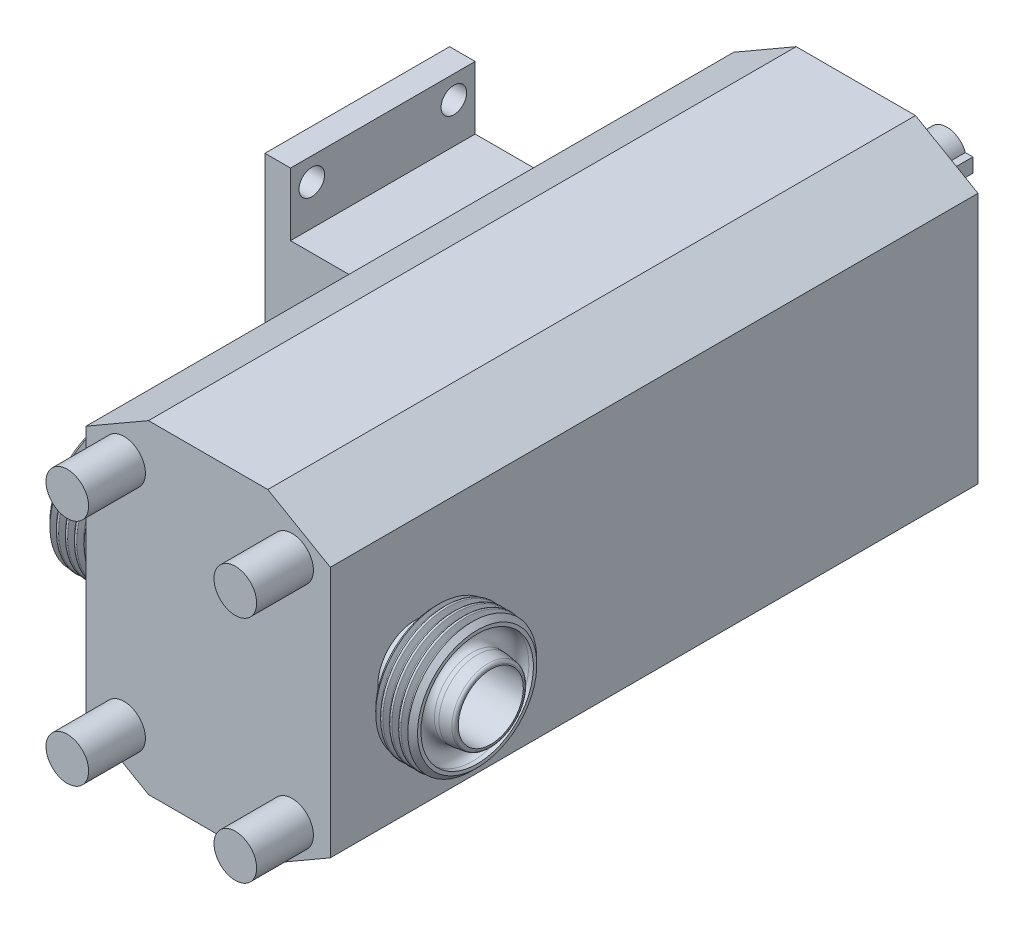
ISO-10303-21;
HEADER;
FILE_DESCRIPTION(('STEP AP214'),'2;1');
FILE_NAME('part.step','',(''),(''),'','','');
FILE_SCHEMA(('AUTOMOTIVE_DESIGN { 1 0 10303 214 1 1 1 1 }'));
ENDSEC;
DATA;
#1=APPLICATION_CONTEXT('core data for automotive mechanical design processes');
#2=APPLICATION_PROTOCOL_DEFINITION('international standard','automotive_design',2000,#1);
#3=PRODUCT_CONTEXT('',#1,'mechanical');
#4=PRODUCT('Part','Part','',(#3));
#5=PRODUCT_RELATED_PRODUCT_CATEGORY('part','',(#4));
#6=PRODUCT_DEFINITION_FORMATION('','',#4);
#7=PRODUCT_DEFINITION_CONTEXT('part definition',#1,'design');
#8=PRODUCT_DEFINITION('design','',#6,#7);
#9=PRODUCT_DEFINITION_SHAPE('','',#8);
#10=(LENGTH_UNIT() NAMED_UNIT(*) SI_UNIT(.MILLI.,.METRE.));
#11=(NAMED_UNIT(*) PLANE_ANGLE_UNIT() SI_UNIT($,.RADIAN.));
#12=(NAMED_UNIT(*) SI_UNIT($,.STERADIAN.) SOLID_ANGLE_UNIT());
#13=UNCERTAINTY_MEASURE_WITH_UNIT(LENGTH_MEASURE(1.E-05),#10,'distance_accuracy_value','');
#14=(GEOMETRIC_REPRESENTATION_CONTEXT(3) GLOBAL_UNCERTAINTY_ASSIGNED_CONTEXT((#13)) GLOBAL_UNIT_ASSIGNED_CONTEXT((#10,
#11,#12)) REPRESENTATION_CONTEXT('',''));
#15=CARTESIAN_POINT('',(0.,0.,0.));
#16=DIRECTION('',(0.,0.,1.));
#17=DIRECTION('',(1.,0.,0.));
#18=AXIS2_PLACEMENT_3D('',#15,#16,#17);
#19=CARTESIAN_POINT('',(-64.7,0.,198.));
#20=DIRECTION('',(1.,0.,0.));
#21=DIRECTION('',(0.,-0.651722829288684,0.758457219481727));
#22=AXIS2_PLACEMENT_3D('',#19,#20,#21);
#23=CONICAL_SURFACE('',#22,21.,0.785398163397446);
#24=CARTESIAN_POINT('',(-64.7,0.,198.));
#25=DIRECTION('',(-1.,0.,0.));
#26=DIRECTION('',(0.,0.651722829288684,-0.758457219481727));
#27=AXIS2_PLACEMENT_3D('',#24,#25,#26);
#28=CIRCLE('',#27,21.);
#29=CARTESIAN_POINT('',(-64.7,13.6861794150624,182.072398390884));
#30=VERTEX_POINT('',#29);
#31=EDGE_CURVE('P0_E53',#30,#30,#28,.T.);
#32=ORIENTED_EDGE('',*,*,#31,.F.);
#33=EDGE_LOOP('',(#32));
#34=FACE_BOUND('',#33,.T.);
#35=CARTESIAN_POINT('',(-62.9945800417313,0.,198.));
#36=DIRECTION('',(-1.,0.,0.));
#37=DIRECTION('',(0.,0.651722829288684,-0.758457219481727));
#38=AXIS2_PLACEMENT_3D('',#35,#36,#37);
#39=CIRCLE('',#38,22.7054199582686);
#40=CARTESIAN_POINT('',(-62.9945800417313,14.7976405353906,180.778910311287));
#41=VERTEX_POINT('',#40);
#42=EDGE_CURVE('P0_E19',#41,#41,#39,.T.);
#43=ORIENTED_EDGE('',*,*,#42,.T.);
#44=EDGE_LOOP('',(#43));
#45=FACE_BOUND('',#44,.T.);
#46=ADVANCED_FACE('P0_F15',(#34,#45),#23,.T.);
#47=CARTESIAN_POINT('',(-52.,0.,198.));
#48=DIRECTION('',(-1.,0.,0.));
#49=DIRECTION('',(0.,0.651722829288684,-0.758457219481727));
#50=AXIS2_PLACEMENT_3D('',#47,#48,#49);
#51=CONICAL_SURFACE('',#50,23.,0.785398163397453);
#52=CARTESIAN_POINT('',(-50.,0.,198.));
#53=DIRECTION('',(-1.,0.,0.));
#54=DIRECTION('',(0.,0.651722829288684,-0.758457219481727));
#55=AXIS2_PLACEMENT_3D('',#52,#53,#54);
#56=CIRCLE('',#55,21.);
#57=CARTESIAN_POINT('',(-50.,13.6861794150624,182.072398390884));
#58=VERTEX_POINT('',#57);
#59=EDGE_CURVE('P0_E50',#58,#58,#56,.T.);
#60=ORIENTED_EDGE('',*,*,#59,.T.);
#61=EDGE_LOOP('',(#60));
#62=FACE_BOUND('',#61,.T.);
#63=CARTESIAN_POINT('',(-51.3272715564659,0.,198.));
#64=DIRECTION('',(1.,0.,0.));
#65=DIRECTION('',(0.,-0.651722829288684,0.758457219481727));
#66=AXIS2_PLACEMENT_3D('',#63,#64,#65);
#67=CIRCLE('',#66,22.327271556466);
#68=CARTESIAN_POINT('',(-51.3272715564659,-14.5511925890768,214.934280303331));
#69=VERTEX_POINT('',#68);
#70=EDGE_CURVE('P0_E31',#69,#69,#67,.T.);
#71=ORIENTED_EDGE('',*,*,#70,.T.);
#72=EDGE_LOOP('',(#71));
#73=FACE_BOUND('',#72,.T.);
#74=ADVANCED_FACE('P0_F98',(#62,#73),#51,.T.);
#75=CARTESIAN_POINT('',(-47.5,0.,198.));
#76=DIRECTION('',(-1.,0.,0.));
#77=DIRECTION('',(0.,0.651722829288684,-0.758457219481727));
#78=AXIS2_PLACEMENT_3D('',#75,#76,#77);
#79=TOROIDAL_SURFACE('',#78,15.75,2.5);
#80=CARTESIAN_POINT('',(-47.5,0.,198.));
#81=DIRECTION('',(-1.,0.,0.));
#82=DIRECTION('',(0.,0.651722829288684,-0.758457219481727));
#83=AXIS2_PLACEMENT_3D('',#80,#81,#82);
#84=CIRCLE('',#83,13.25);
#85=CARTESIAN_POINT('',(-47.5,8.63532748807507,187.950441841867));
#86=VERTEX_POINT('',#85);
#87=EDGE_CURVE('P0_E10',#86,#86,#84,.T.);
#88=ORIENTED_EDGE('',*,*,#87,.T.);
#89=EDGE_LOOP('',(#88));
#90=FACE_BOUND('',#89,.T.);
#91=CARTESIAN_POINT('',(-50.,0.,198.));
#92=DIRECTION('',(-1.,0.,0.));
#93=DIRECTION('',(0.,0.651722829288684,-0.758457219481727));
#94=AXIS2_PLACEMENT_3D('',#91,#92,#93);
#95=CIRCLE('',#94,15.75);
#96=CARTESIAN_POINT('',(-50.,10.2646345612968,186.054298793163));
#97=VERTEX_POINT('',#96);
#98=EDGE_CURVE('P0_E37',#97,#97,#95,.T.);
#99=ORIENTED_EDGE('',*,*,#98,.F.);
#100=EDGE_LOOP('',(#99));
#101=FACE_BOUND('',#100,.T.);
#102=ADVANCED_FACE('P0_F17',(#90,#101),#79,.F.);
#103=CARTESIAN_POINT('',(-80.7212301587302,0.,198.));
#104=DIRECTION('',(-1.,0.,0.));
#105=DIRECTION('',(0.,0.651722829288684,-0.758457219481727));
#106=AXIS2_PLACEMENT_3D('',#103,#104,#105);
#107=CYLINDRICAL_SURFACE('',#106,13.25);
#108=CARTESIAN_POINT('',(-43.,0.,198.));
#109=DIRECTION('',(-1.,0.,0.));
#110=DIRECTION('',(0.,0.651722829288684,-0.758457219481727));
#111=AXIS2_PLACEMENT_3D('',#108,#109,#110);
#112=CIRCLE('',#111,13.25);
#113=CARTESIAN_POINT('',(-43.,8.63532748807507,187.950441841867));
#114=VERTEX_POINT('',#113);
#115=EDGE_CURVE('P0_E23',#114,#114,#112,.T.);
#116=ORIENTED_EDGE('',*,*,#115,.T.);
#117=EDGE_LOOP('',(#116));
#118=FACE_BOUND('',#117,.T.);
#119=ORIENTED_EDGE('',*,*,#87,.F.);
#120=EDGE_LOOP('',(#119));
#121=FACE_BOUND('',#120,.T.);
#122=ADVANCED_FACE('P0_F95',(#118,#121),#107,.T.);
#123=CARTESIAN_POINT('',(-43.,8.68433516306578,205.462226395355));
#124=DIRECTION('',(1.,0.,0.));
#125=DIRECTION('',(0.,-0.651722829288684,0.758457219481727));
#126=AXIS2_PLACEMENT_3D('',#123,#124,#125);
#127=PLANE('',#126);
#128=CARTESIAN_POINT('',(-43.,0.,198.));
#129=DIRECTION('',(-1.,0.,0.));
#130=DIRECTION('',(0.,0.651722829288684,-0.758457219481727));
#131=AXIS2_PLACEMENT_3D('',#128,#129,#130);
#132=CIRCLE('',#131,11.45);
#133=CARTESIAN_POINT('',(-43.,7.46222639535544,189.315664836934));
#134=VERTEX_POINT('',#133);
#135=EDGE_CURVE('P0_E28',#134,#134,#132,.T.);
#136=ORIENTED_EDGE('',*,*,#135,.T.);
#137=EDGE_LOOP('',(#136));
#138=FACE_BOUND('',#137,.T.);
#139=ORIENTED_EDGE('',*,*,#115,.F.);
#140=EDGE_LOOP('',(#139));
#141=FACE_BOUND('',#140,.T.);
#142=ADVANCED_FACE('P0_F79',(#138,#141),#127,.T.);
#143=CARTESIAN_POINT('',(-80.7212301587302,0.,198.));
#144=DIRECTION('',(-1.,0.,0.));
#145=DIRECTION('',(0.,0.651722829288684,-0.758457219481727));
#146=AXIS2_PLACEMENT_3D('',#143,#144,#145);
#147=CYLINDRICAL_SURFACE('',#146,11.45);
#148=CARTESIAN_POINT('',(-69.5,0.,198.));
#149=DIRECTION('',(-1.,0.,0.));
#150=DIRECTION('',(0.,0.651722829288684,-0.758457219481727));
#151=AXIS2_PLACEMENT_3D('',#148,#149,#150);
#152=CIRCLE('',#151,11.45);
#153=CARTESIAN_POINT('',(-69.5,7.46222639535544,189.315664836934));
#154=VERTEX_POINT('',#153);
#155=EDGE_CURVE('P0_E74',#154,#154,#152,.T.);
#156=ORIENTED_EDGE('',*,*,#155,.T.);
#157=EDGE_LOOP('',(#156));
#158=FACE_BOUND('',#157,.T.);
#159=ORIENTED_EDGE('',*,*,#135,.F.);
#160=EDGE_LOOP('',(#159));
#161=FACE_BOUND('',#160,.T.);
#162=ADVANCED_FACE('P0_F82',(#158,#161),#147,.F.);
#163=CARTESIAN_POINT('',(-69.5,9.00363053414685,205.736588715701));
#164=DIRECTION('',(-1.,0.,0.));
#165=DIRECTION('',(0.,0.651722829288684,-0.758457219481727));
#166=AXIS2_PLACEMENT_3D('',#163,#164,#165);
#167=PLANE('',#166);
#168=CARTESIAN_POINT('',(-69.5,0.,198.));
#169=DIRECTION('',(-1.,0.,0.));
#170=DIRECTION('',(0.,0.651722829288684,-0.758457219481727));
#171=AXIS2_PLACEMENT_3D('',#168,#169,#170);
#172=CIRCLE('',#171,11.8709800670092);
#173=CARTESIAN_POINT('',(-69.5,7.73658871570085,188.996369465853));
#174=VERTEX_POINT('',#173);
#175=EDGE_CURVE('P0_E71',#174,#174,#172,.T.);
#176=ORIENTED_EDGE('',*,*,#175,.T.);
#177=EDGE_LOOP('',(#176));
#178=FACE_BOUND('',#177,.T.);
#179=ORIENTED_EDGE('',*,*,#155,.F.);
#180=EDGE_LOOP('',(#179));
#181=FACE_BOUND('',#180,.T.);
#182=ADVANCED_FACE('P0_F84',(#178,#181),#167,.T.);
#183=CARTESIAN_POINT('',(-68.5,0.,198.));
#184=DIRECTION('',(-1.,0.,0.));
#185=DIRECTION('',(0.,0.651722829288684,-0.758457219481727));
#186=AXIS2_PLACEMENT_3D('',#183,#184,#185);
#187=TOROIDAL_SURFACE('',#186,11.8709800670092,1.);
#188=CARTESIAN_POINT('',(-68.6478094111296,0.,198.));
#189=DIRECTION('',(-1.,0.,0.));
#190=DIRECTION('',(0.,0.651722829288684,-0.758457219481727));
#191=AXIS2_PLACEMENT_3D('',#188,#189,#190);
#192=CIRCLE('',#191,12.8599959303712);
#193=CARTESIAN_POINT('',(-68.6478094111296,8.38115293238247,188.246243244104));
#194=VERTEX_POINT('',#193);
#195=EDGE_CURVE('P0_E68',#194,#194,#192,.T.);
#196=ORIENTED_EDGE('',*,*,#195,.T.);
#197=EDGE_LOOP('',(#196));
#198=FACE_BOUND('',#197,.T.);
#199=ORIENTED_EDGE('',*,*,#175,.F.);
#200=EDGE_LOOP('',(#199));
#201=FACE_BOUND('',#200,.T.);
#202=ADVANCED_FACE('P0_F92',(#198,#201),#187,.T.);
#203=CARTESIAN_POINT('',(-68.6478094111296,0.,198.));
#204=DIRECTION('',(1.,0.,0.));
#205=DIRECTION('',(0.,-0.651722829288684,0.758457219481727));
#206=AXIS2_PLACEMENT_3D('',#203,#204,#205);
#207=CONICAL_SURFACE('',#206,12.8599959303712,0.148352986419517);
#208=CARTESIAN_POINT('',(-64.7,0.,198.));
#209=DIRECTION('',(-1.,0.,0.));
#210=DIRECTION('',(0.,0.651722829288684,-0.758457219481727));
#211=AXIS2_PLACEMENT_3D('',#208,#209,#210);
#212=CIRCLE('',#211,13.45);
#213=CARTESIAN_POINT('',(-64.7,8.76567205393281,187.798750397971));
#214=VERTEX_POINT('',#213);
#215=EDGE_CURVE('P0_E65',#214,#214,#212,.T.);
#216=ORIENTED_EDGE('',*,*,#215,.T.);
#217=EDGE_LOOP('',(#216));
#218=FACE_BOUND('',#217,.T.);
#219=ORIENTED_EDGE('',*,*,#195,.F.);
#220=EDGE_LOOP('',(#219));
#221=FACE_BOUND('',#220,.T.);
#222=ADVANCED_FACE('P0_F126',(#218,#221),#207,.T.);
#223=CARTESIAN_POINT('',(-80.7212301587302,0.,198.));
#224=DIRECTION('',(-1.,0.,0.));
#225=DIRECTION('',(0.,0.651722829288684,-0.758457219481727));
#226=AXIS2_PLACEMENT_3D('',#223,#224,#225);
#227=CYLINDRICAL_SURFACE('',#226,13.45);
#228=CARTESIAN_POINT('',(-63.1,0.,198.));
#229=DIRECTION('',(-1.,0.,0.));
#230=DIRECTION('',(0.,0.651722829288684,-0.758457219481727));
#231=AXIS2_PLACEMENT_3D('',#228,#229,#230);
#232=CIRCLE('',#231,13.45);
#233=CARTESIAN_POINT('',(-63.1,8.76567205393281,187.798750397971));
#234=VERTEX_POINT('',#233);
#235=EDGE_CURVE('P0_E62',#234,#234,#232,.T.);
#236=ORIENTED_EDGE('',*,*,#235,.T.);
#237=EDGE_LOOP('',(#236));
#238=FACE_BOUND('',#237,.T.);
#239=ORIENTED_EDGE('',*,*,#215,.F.);
#240=EDGE_LOOP('',(#239));
#241=FACE_BOUND('',#240,.T.);
#242=ADVANCED_FACE('P0_F122',(#238,#241),#227,.T.);
#243=CARTESIAN_POINT('',(-63.1,0.,198.));
#244=DIRECTION('',(-1.,0.,0.));
#245=DIRECTION('',(0.,0.651722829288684,-0.758457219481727));
#246=AXIS2_PLACEMENT_3D('',#243,#244,#245);
#247=TOROIDAL_SURFACE('',#246,16.625,3.175);
#248=CARTESIAN_POINT('',(-63.1,0.,198.));
#249=DIRECTION('',(-1.,0.,0.));
#250=DIRECTION('',(0.,0.651722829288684,-0.758457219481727));
#251=AXIS2_PLACEMENT_3D('',#248,#249,#250);
#252=CIRCLE('',#251,19.8);
#253=CARTESIAN_POINT('',(-63.1,12.9041120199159,182.982547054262));
#254=VERTEX_POINT('',#253);
#255=EDGE_CURVE('P0_E59',#254,#254,#252,.T.);
#256=ORIENTED_EDGE('',*,*,#255,.T.);
#257=EDGE_LOOP('',(#256));
#258=FACE_BOUND('',#257,.T.);
#259=ORIENTED_EDGE('',*,*,#235,.F.);
#260=EDGE_LOOP('',(#259));
#261=FACE_BOUND('',#260,.T.);
#262=ADVANCED_FACE('P0_F118',(#258,#261),#247,.F.);
#263=CARTESIAN_POINT('',(-80.7212301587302,0.,198.));
#264=DIRECTION('',(-1.,0.,0.));
#265=DIRECTION('',(0.,0.651722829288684,-0.758457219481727));
#266=AXIS2_PLACEMENT_3D('',#263,#264,#265);
#267=CYLINDRICAL_SURFACE('',#266,19.8);
#268=CARTESIAN_POINT('',(-64.7,0.,198.));
#269=DIRECTION('',(-1.,0.,0.));
#270=DIRECTION('',(0.,0.651722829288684,-0.758457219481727));
#271=AXIS2_PLACEMENT_3D('',#268,#269,#270);
#272=CIRCLE('',#271,19.8);
#273=CARTESIAN_POINT('',(-64.7,12.904112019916,182.982547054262));
#274=VERTEX_POINT('',#273);
#275=EDGE_CURVE('P0_E56',#274,#274,#272,.T.);
#276=ORIENTED_EDGE('',*,*,#275,.T.);
#277=EDGE_LOOP('',(#276));
#278=FACE_BOUND('',#277,.T.);
#279=ORIENTED_EDGE('',*,*,#255,.F.);
#280=EDGE_LOOP('',(#279));
#281=FACE_BOUND('',#280,.T.);
#282=ADVANCED_FACE('P0_F114',(#278,#281),#267,.F.);
#283=CARTESIAN_POINT('',(-64.7,15.9276016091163,211.686179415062));
#284=DIRECTION('',(-1.,0.,0.));
#285=DIRECTION('',(0.,0.651722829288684,-0.758457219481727));
#286=AXIS2_PLACEMENT_3D('',#283,#284,#285);
#287=PLANE('',#286);
#288=ORIENTED_EDGE('',*,*,#31,.T.);
#289=EDGE_LOOP('',(#288));
#290=FACE_BOUND('',#289,.T.);
#291=ORIENTED_EDGE('',*,*,#275,.F.);
#292=EDGE_LOOP('',(#291));
#293=FACE_BOUND('',#292,.T.);
#294=ADVANCED_FACE('P0_F110',(#290,#293),#287,.T.);
#295=CARTESIAN_POINT('',(-50.,11.9457012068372,208.264634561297));
#296=DIRECTION('',(1.,0.,0.));
#297=DIRECTION('',(0.,-0.651722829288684,0.758457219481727));
#298=AXIS2_PLACEMENT_3D('',#295,#296,#297);
#299=PLANE('',#298);
#300=ORIENTED_EDGE('',*,*,#98,.T.);
#301=EDGE_LOOP('',(#300));
#302=FACE_BOUND('',#301,.T.);
#303=ORIENTED_EDGE('',*,*,#59,.F.);
#304=EDGE_LOOP('',(#303));
#305=FACE_BOUND('',#304,.T.);
#306=ADVANCED_FACE('P0_F113',(#302,#305),#299,.T.);
#307=CARTESIAN_POINT('',(-60.2375,0.,198.));
#308=DIRECTION('',(-1.,0.,0.));
#309=DIRECTION('',(0.,0.651722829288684,-0.758457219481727));
#310=AXIS2_PLACEMENT_3D('',#307,#308,#309);
#311=TOROIDAL_SURFACE('',#310,22.564,0.435999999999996);
#312=CARTESIAN_POINT('',(-60.6242367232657,0.,198.));
#313=DIRECTION('',(-1.,0.,0.));
#314=DIRECTION('',(0.,0.651722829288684,-0.758457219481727));
#315=AXIS2_PLACEMENT_3D('',#312,#313,#314);
#316=CIRCLE('',#315,22.7653223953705);
#317=CARTESIAN_POINT('',(-60.6242367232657,14.8366803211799,180.733476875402));
#318=VERTEX_POINT('',#317);
#319=EDGE_CURVE('P0_E44',#318,#318,#316,.T.);
#320=ORIENTED_EDGE('',*,*,#319,.F.);
#321=EDGE_LOOP('',(#320));
#322=FACE_BOUND('',#321,.T.);
#323=CARTESIAN_POINT('',(-59.8507632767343,0.,198.));
#324=DIRECTION('',(-1.,0.,0.));
#325=DIRECTION('',(0.,0.651722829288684,-0.758457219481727));
#326=AXIS2_PLACEMENT_3D('',#323,#324,#325);
#327=CIRCLE('',#326,22.7653223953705);
#328=CARTESIAN_POINT('',(-59.8507632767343,14.8366803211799,180.733476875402));
#329=VERTEX_POINT('',#328);
#330=EDGE_CURVE('P0_E329',#329,#329,#327,.T.);
#331=ORIENTED_EDGE('',*,*,#330,.T.);
#332=EDGE_LOOP('',(#331));
#333=FACE_BOUND('',#332,.T.);
#334=ADVANCED_FACE('P0_F172',(#322,#333),#311,.T.);
#335=CARTESIAN_POINT('',(-57.0625,0.,198.));
#336=DIRECTION('',(-1.,0.,0.));
#337=DIRECTION('',(0.,0.651722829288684,-0.758457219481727));
#338=AXIS2_PLACEMENT_3D('',#335,#336,#337);
#339=TOROIDAL_SURFACE('',#338,22.564,0.435999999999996);
#340=CARTESIAN_POINT('',(-57.4492367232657,0.,198.));
#341=DIRECTION('',(-1.,0.,0.));
#342=DIRECTION('',(0.,0.651722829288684,-0.758457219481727));
#343=AXIS2_PLACEMENT_3D('',#340,#341,#342);
#344=CIRCLE('',#343,22.7653223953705);
#345=CARTESIAN_POINT('',(-57.4492367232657,14.8366803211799,180.733476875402));
#346=VERTEX_POINT('',#345);
#347=EDGE_CURVE('P0_E320',#346,#346,#344,.T.);
#348=ORIENTED_EDGE('',*,*,#347,.F.);
#349=EDGE_LOOP('',(#348));
#350=FACE_BOUND('',#349,.T.);
#351=CARTESIAN_POINT('',(-56.6757632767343,0.,198.));
#352=DIRECTION('',(-1.,0.,0.));
#353=DIRECTION('',(0.,0.651722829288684,-0.758457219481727));
#354=AXIS2_PLACEMENT_3D('',#351,#352,#353);
#355=CIRCLE('',#354,22.7653223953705);
#356=CARTESIAN_POINT('',(-56.6757632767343,14.8366803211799,180.733476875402));
#357=VERTEX_POINT('',#356);
#358=EDGE_CURVE('P0_E317',#357,#357,#355,.T.);
#359=ORIENTED_EDGE('',*,*,#358,.T.);
#360=EDGE_LOOP('',(#359));
#361=FACE_BOUND('',#360,.T.);
#362=ADVANCED_FACE('P0_F179',(#350,#361),#339,.T.);
#363=CARTESIAN_POINT('',(-53.8875,0.,198.));
#364=DIRECTION('',(-1.,0.,0.));
#365=DIRECTION('',(0.,0.651722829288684,-0.758457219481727));
#366=AXIS2_PLACEMENT_3D('',#363,#364,#365);
#367=TOROIDAL_SURFACE('',#366,22.564,0.435999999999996);
#368=CARTESIAN_POINT('',(-54.2742367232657,0.,198.));
#369=DIRECTION('',(-1.,0.,0.));
#370=DIRECTION('',(0.,0.651722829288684,-0.758457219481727));
#371=AXIS2_PLACEMENT_3D('',#368,#369,#370);
#372=CIRCLE('',#371,22.7653223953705);
#373=CARTESIAN_POINT('',(-54.2742367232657,14.8366803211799,180.733476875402));
#374=VERTEX_POINT('',#373);
#375=EDGE_CURVE('P0_E308',#374,#374,#372,.T.);
#376=ORIENTED_EDGE('',*,*,#375,.F.);
#377=EDGE_LOOP('',(#376));
#378=FACE_BOUND('',#377,.T.);
#379=CARTESIAN_POINT('',(-53.5007632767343,0.,198.));
#380=DIRECTION('',(-1.,0.,0.));
#381=DIRECTION('',(0.,0.651722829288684,-0.758457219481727));
#382=AXIS2_PLACEMENT_3D('',#379,#380,#381);
#383=CIRCLE('',#382,22.7653223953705);
#384=CARTESIAN_POINT('',(-53.5007632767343,14.8366803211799,180.733476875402));
#385=VERTEX_POINT('',#384);
#386=EDGE_CURVE('P0_E303',#385,#385,#383,.T.);
#387=ORIENTED_EDGE('',*,*,#386,.T.);
#388=EDGE_LOOP('',(#387));
#389=FACE_BOUND('',#388,.T.);
#390=ADVANCED_FACE('P0_F187',(#378,#389),#367,.T.);
#391=CARTESIAN_POINT('',(-63.0257632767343,0.,198.));
#392=DIRECTION('',(-1.,0.,0.));
#393=DIRECTION('',(0.,0.651722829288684,-0.758457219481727));
#394=AXIS2_PLACEMENT_3D('',#391,#392,#393);
#395=CONICAL_SURFACE('',#394,22.7653223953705,1.09083078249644);
#396=ORIENTED_EDGE('',*,*,#42,.F.);
#397=EDGE_LOOP('',(#396));
#398=FACE_BOUND('',#397,.T.);
#399=CARTESIAN_POINT('',(-62.2117367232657,0.,198.));
#400=DIRECTION('',(-1.,0.,0.));
#401=DIRECTION('',(0.,0.651722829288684,-0.758457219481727));
#402=AXIS2_PLACEMENT_3D('',#399,#400,#401);
#403=CIRCLE('',#402,21.2015919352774);
#404=CARTESIAN_POINT('',(-62.2117367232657,13.8175614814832,181.919499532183));
#405=VERTEX_POINT('',#404);
#406=EDGE_CURVE('P0_E33',#405,#405,#403,.T.);
#407=ORIENTED_EDGE('',*,*,#406,.T.);
#408=EDGE_LOOP('',(#407));
#409=FACE_BOUND('',#408,.T.);
#410=ADVANCED_FACE('P0_F195',(#398,#409),#395,.T.);
#411=CARTESIAN_POINT('',(-61.825,0.,198.));
#412=DIRECTION('',(-1.,0.,0.));
#413=DIRECTION('',(0.,0.651722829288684,-0.758457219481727));
#414=AXIS2_PLACEMENT_3D('',#411,#412,#413);
#415=TOROIDAL_SURFACE('',#414,21.4029143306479,0.436000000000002);
#416=CARTESIAN_POINT('',(-61.4382632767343,0.,198.));
#417=DIRECTION('',(-1.,0.,0.));
#418=DIRECTION('',(0.,0.651722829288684,-0.758457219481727));
#419=AXIS2_PLACEMENT_3D('',#416,#417,#418);
#420=CIRCLE('',#419,21.2015919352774);
#421=CARTESIAN_POINT('',(-61.4382632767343,13.8175614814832,181.919499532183));
#422=VERTEX_POINT('',#421);
#423=EDGE_CURVE('P0_E39',#422,#422,#420,.T.);
#424=ORIENTED_EDGE('',*,*,#423,.T.);
#425=EDGE_LOOP('',(#424));
#426=FACE_BOUND('',#425,.T.);
#427=ORIENTED_EDGE('',*,*,#406,.F.);
#428=EDGE_LOOP('',(#427));
#429=FACE_BOUND('',#428,.T.);
#430=ADVANCED_FACE('P0_F203',(#426,#429),#415,.F.);
#431=CARTESIAN_POINT('',(-61.4382632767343,0.,198.));
#432=DIRECTION('',(1.,0.,0.));
#433=DIRECTION('',(0.,-0.651722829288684,0.758457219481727));
#434=AXIS2_PLACEMENT_3D('',#431,#432,#433);
#435=CONICAL_SURFACE('',#434,21.2015919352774,1.09083078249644);
#436=ORIENTED_EDGE('',*,*,#319,.T.);
#437=EDGE_LOOP('',(#436));
#438=FACE_BOUND('',#437,.T.);
#439=ORIENTED_EDGE('',*,*,#423,.F.);
#440=EDGE_LOOP('',(#439));
#441=FACE_BOUND('',#440,.T.);
#442=ADVANCED_FACE('P0_F211',(#438,#441),#435,.T.);
#443=CARTESIAN_POINT('',(-59.8507632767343,0.,198.));
#444=DIRECTION('',(-1.,0.,0.));
#445=DIRECTION('',(0.,0.651722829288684,-0.758457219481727));
#446=AXIS2_PLACEMENT_3D('',#443,#444,#445);
#447=CONICAL_SURFACE('',#446,22.7653223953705,1.09083078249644);
#448=CARTESIAN_POINT('',(-59.0367367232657,0.,198.));
#449=DIRECTION('',(-1.,0.,0.));
#450=DIRECTION('',(0.,0.651722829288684,-0.758457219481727));
#451=AXIS2_PLACEMENT_3D('',#448,#449,#450);
#452=CIRCLE('',#451,21.2015919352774);
#453=CARTESIAN_POINT('',(-59.0367367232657,13.8175614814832,181.919499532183));
#454=VERTEX_POINT('',#453);
#455=EDGE_CURVE('P0_E326',#454,#454,#452,.T.);
#456=ORIENTED_EDGE('',*,*,#455,.T.);
#457=EDGE_LOOP('',(#456));
#458=FACE_BOUND('',#457,.T.);
#459=ORIENTED_EDGE('',*,*,#330,.F.);
#460=EDGE_LOOP('',(#459));
#461=FACE_BOUND('',#460,.T.);
#462=ADVANCED_FACE('P0_F219',(#458,#461),#447,.T.);
#463=CARTESIAN_POINT('',(-58.65,0.,198.));
#464=DIRECTION('',(-1.,0.,0.));
#465=DIRECTION('',(0.,0.651722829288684,-0.758457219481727));
#466=AXIS2_PLACEMENT_3D('',#463,#464,#465);
#467=TOROIDAL_SURFACE('',#466,21.4029143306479,0.436000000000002);
#468=CARTESIAN_POINT('',(-58.2632632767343,0.,198.));
#469=DIRECTION('',(-1.,0.,0.));
#470=DIRECTION('',(0.,0.651722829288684,-0.758457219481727));
#471=AXIS2_PLACEMENT_3D('',#468,#469,#470);
#472=CIRCLE('',#471,21.2015919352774);
#473=CARTESIAN_POINT('',(-58.2632632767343,13.8175614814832,181.919499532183));
#474=VERTEX_POINT('',#473);
#475=EDGE_CURVE('P0_E323',#474,#474,#472,.T.);
#476=ORIENTED_EDGE('',*,*,#475,.T.);
#477=EDGE_LOOP('',(#476));
#478=FACE_BOUND('',#477,.T.);
#479=ORIENTED_EDGE('',*,*,#455,.F.);
#480=EDGE_LOOP('',(#479));
#481=FACE_BOUND('',#480,.T.);
#482=ADVANCED_FACE('P0_F227',(#478,#481),#467,.F.);
#483=CARTESIAN_POINT('',(-58.2632632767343,0.,198.));
#484=DIRECTION('',(1.,0.,0.));
#485=DIRECTION('',(0.,-0.651722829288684,0.758457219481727));
#486=AXIS2_PLACEMENT_3D('',#483,#484,#485);
#487=CONICAL_SURFACE('',#486,21.2015919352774,1.09083078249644);
#488=ORIENTED_EDGE('',*,*,#347,.T.);
#489=EDGE_LOOP('',(#488));
#490=FACE_BOUND('',#489,.T.);
#491=ORIENTED_EDGE('',*,*,#475,.F.);
#492=EDGE_LOOP('',(#491));
#493=FACE_BOUND('',#492,.T.);
#494=ADVANCED_FACE('P0_F235',(#490,#493),#487,.T.);
#495=CARTESIAN_POINT('',(-56.6757632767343,0.,198.));
#496=DIRECTION('',(-1.,0.,0.));
#497=DIRECTION('',(0.,0.651722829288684,-0.758457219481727));
#498=AXIS2_PLACEMENT_3D('',#495,#496,#497);
#499=CONICAL_SURFACE('',#498,22.7653223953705,1.09083078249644);
#500=CARTESIAN_POINT('',(-55.8617367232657,0.,198.));
#501=DIRECTION('',(-1.,0.,0.));
#502=DIRECTION('',(0.,0.651722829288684,-0.758457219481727));
#503=AXIS2_PLACEMENT_3D('',#500,#501,#502);
#504=CIRCLE('',#503,21.2015919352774);
#505=CARTESIAN_POINT('',(-55.8617367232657,13.8175614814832,181.919499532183));
#506=VERTEX_POINT('',#505);
#507=EDGE_CURVE('P0_E314',#506,#506,#504,.T.);
#508=ORIENTED_EDGE('',*,*,#507,.T.);
#509=EDGE_LOOP('',(#508));
#510=FACE_BOUND('',#509,.T.);
#511=ORIENTED_EDGE('',*,*,#358,.F.);
#512=EDGE_LOOP('',(#511));
#513=FACE_BOUND('',#512,.T.);
#514=ADVANCED_FACE('P0_F243',(#510,#513),#499,.T.);
#515=CARTESIAN_POINT('',(-55.475,0.,198.));
#516=DIRECTION('',(-1.,0.,0.));
#517=DIRECTION('',(0.,0.651722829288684,-0.758457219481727));
#518=AXIS2_PLACEMENT_3D('',#515,#516,#517);
#519=TOROIDAL_SURFACE('',#518,21.4029143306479,0.436000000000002);
#520=CARTESIAN_POINT('',(-55.0882632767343,0.,198.));
#521=DIRECTION('',(-1.,0.,0.));
#522=DIRECTION('',(0.,0.651722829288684,-0.758457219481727));
#523=AXIS2_PLACEMENT_3D('',#520,#521,#522);
#524=CIRCLE('',#523,21.2015919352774);
#525=CARTESIAN_POINT('',(-55.0882632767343,13.8175614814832,181.919499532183));
#526=VERTEX_POINT('',#525);
#527=EDGE_CURVE('P0_E311',#526,#526,#524,.T.);
#528=ORIENTED_EDGE('',*,*,#527,.T.);
#529=EDGE_LOOP('',(#528));
#530=FACE_BOUND('',#529,.T.);
#531=ORIENTED_EDGE('',*,*,#507,.F.);
#532=EDGE_LOOP('',(#531));
#533=FACE_BOUND('',#532,.T.);
#534=ADVANCED_FACE('P0_F251',(#530,#533),#519,.F.);
#535=CARTESIAN_POINT('',(-55.0882632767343,0.,198.));
#536=DIRECTION('',(1.,0.,0.));
#537=DIRECTION('',(0.,-0.651722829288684,0.758457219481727));
#538=AXIS2_PLACEMENT_3D('',#535,#536,#537);
#539=CONICAL_SURFACE('',#538,21.2015919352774,1.09083078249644);
#540=ORIENTED_EDGE('',*,*,#375,.T.);
#541=EDGE_LOOP('',(#540));
#542=FACE_BOUND('',#541,.T.);
#543=ORIENTED_EDGE('',*,*,#527,.F.);
#544=EDGE_LOOP('',(#543));
#545=FACE_BOUND('',#544,.T.);
#546=ADVANCED_FACE('P0_F259',(#542,#545),#539,.T.);
#547=CARTESIAN_POINT('',(-53.5007632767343,0.,198.));
#548=DIRECTION('',(-1.,0.,0.));
#549=DIRECTION('',(0.,0.651722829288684,-0.758457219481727));
#550=AXIS2_PLACEMENT_3D('',#547,#548,#549);
#551=CONICAL_SURFACE('',#550,22.7653223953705,1.09083078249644);
#552=CARTESIAN_POINT('',(-52.6867367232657,0.,198.));
#553=DIRECTION('',(-1.,0.,0.));
#554=DIRECTION('',(0.,0.651722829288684,-0.758457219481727));
#555=AXIS2_PLACEMENT_3D('',#552,#553,#554);
#556=CIRCLE('',#555,21.2015919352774);
#557=CARTESIAN_POINT('',(-52.6867367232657,13.8175614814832,181.919499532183));
#558=VERTEX_POINT('',#557);
#559=EDGE_CURVE('P0_E300',#558,#558,#556,.T.);
#560=ORIENTED_EDGE('',*,*,#559,.T.);
#561=EDGE_LOOP('',(#560));
#562=FACE_BOUND('',#561,.T.);
#563=ORIENTED_EDGE('',*,*,#386,.F.);
#564=EDGE_LOOP('',(#563));
#565=FACE_BOUND('',#564,.T.);
#566=ADVANCED_FACE('P0_F267',(#562,#565),#551,.T.);
#567=CARTESIAN_POINT('',(-52.3,0.,198.));
#568=DIRECTION('',(-1.,0.,0.));
#569=DIRECTION('',(0.,0.651722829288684,-0.758457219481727));
#570=AXIS2_PLACEMENT_3D('',#567,#568,#569);
#571=TOROIDAL_SURFACE('',#570,21.4029143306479,0.436000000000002);
#572=CARTESIAN_POINT('',(-51.9132632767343,0.,198.));
#573=DIRECTION('',(-1.,0.,0.));
#574=DIRECTION('',(0.,0.651722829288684,-0.758457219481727));
#575=AXIS2_PLACEMENT_3D('',#572,#573,#574);
#576=CIRCLE('',#575,21.2015919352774);
#577=CARTESIAN_POINT('',(-51.9132632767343,13.8175614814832,181.919499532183));
#578=VERTEX_POINT('',#577);
#579=EDGE_CURVE('P0_E299',#578,#578,#576,.T.);
#580=ORIENTED_EDGE('',*,*,#579,.T.);
#581=EDGE_LOOP('',(#580));
#582=FACE_BOUND('',#581,.T.);
#583=ORIENTED_EDGE('',*,*,#559,.F.);
#584=EDGE_LOOP('',(#583));
#585=FACE_BOUND('',#584,.T.);
#586=ADVANCED_FACE('P0_F275',(#582,#585),#571,.F.);
#587=CARTESIAN_POINT('',(-51.9132632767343,0.,198.));
#588=DIRECTION('',(1.,0.,0.));
#589=DIRECTION('',(0.,-0.651722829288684,0.758457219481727));
#590=AXIS2_PLACEMENT_3D('',#587,#588,#589);
#591=CONICAL_SURFACE('',#590,21.2015919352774,1.09083078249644);
#592=ORIENTED_EDGE('',*,*,#70,.F.);
#593=EDGE_LOOP('',(#592));
#594=FACE_BOUND('',#593,.T.);
#595=ORIENTED_EDGE('',*,*,#579,.F.);
#596=EDGE_LOOP('',(#595));
#597=FACE_BOUND('',#596,.T.);
#598=ADVANCED_FACE('P0_F283',(#594,#597),#591,.T.);
#599=CLOSED_SHELL('',(#46,#74,#102,#122,#142,#162,#182,#202,#222,#242,#262,#282,#294,#306,#334,
#362,#390,#410,#430,#442,#462,#482,#494,#514,#534,#546,#566,#586,#598));
#600=MANIFOLD_SOLID_BREP('P0_B1',#599);
#601=CARTESIAN_POINT('',(-43.,-44.2982940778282,228.));
#602=DIRECTION('',(1.,0.,0.));
#603=DIRECTION('',(0.,0.,-1.));
#604=AXIS2_PLACEMENT_3D('',#601,#602,#603);
#605=PLANE('',#604);
#606=DIRECTION('',(0.,-1.,0.));
#607=VECTOR('',#606,1.);
#608=CARTESIAN_POINT('',(-43.,-44.2982940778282,0.));
#609=LINE('',#608,#607);
#610=CARTESIAN_POINT('',(-43.,44.2982940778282,0.));
#611=VERTEX_POINT('',#610);
#612=CARTESIAN_POINT('',(-43.,-44.2982940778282,0.));
#613=VERTEX_POINT('',#612);
#614=EDGE_CURVE('P1_E290',#611,#613,#609,.T.);
#615=ORIENTED_EDGE('',*,*,#614,.T.);
#616=DIRECTION('',(0.,0.,-1.));
#617=VECTOR('',#616,1.);
#618=CARTESIAN_POINT('',(-43.,-44.2982940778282,228.));
#619=LINE('',#618,#617);
#620=CARTESIAN_POINT('',(-43.,-44.2982940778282,228.));
#621=VERTEX_POINT('',#620);
#622=EDGE_CURVE('P1_E320',#621,#613,#619,.T.);
#623=ORIENTED_EDGE('',*,*,#622,.F.);
#624=DIRECTION('',(0.,-1.,0.));
#625=VECTOR('',#624,1.);
#626=CARTESIAN_POINT('',(-43.,-44.2982940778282,228.));
#627=LINE('',#626,#625);
#628=CARTESIAN_POINT('',(-43.,44.2982940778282,228.));
#629=VERTEX_POINT('',#628);
#630=EDGE_CURVE('P1_E272',#629,#621,#627,.T.);
#631=ORIENTED_EDGE('',*,*,#630,.F.);
#632=DIRECTION('',(0.,0.,-1.));
#633=VECTOR('',#632,1.);
#634=CARTESIAN_POINT('',(-43.,44.2982940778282,228.));
#635=LINE('',#634,#633);
#636=EDGE_CURVE('P1_E323',#629,#611,#635,.T.);
#637=ORIENTED_EDGE('',*,*,#636,.T.);
#638=EDGE_LOOP('',(#615,#623,#631,#637));
#639=FACE_BOUND('',#638,.T.);
#640=CARTESIAN_POINT('',(-43.,0.,198.));
#641=DIRECTION('',(1.,0.,0.));
#642=DIRECTION('',(0.,1.,0.));
#643=AXIS2_PLACEMENT_3D('',#640,#641,#642);
#644=CIRCLE('',#643,11.2);
#645=CARTESIAN_POINT('',(-43.,11.2,198.));
#646=VERTEX_POINT('',#645);
#647=EDGE_CURVE('P1_E214',#646,#646,#644,.T.);
#648=ORIENTED_EDGE('',*,*,#647,.T.);
#649=EDGE_LOOP('',(#648));
#650=FACE_BOUND('',#649,.T.);
#651=DIRECTION('',(0.,-1.,0.));
#652=VECTOR('',#651,1.);
#653=CARTESIAN_POINT('',(-43.,-44.2982940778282,63.));
#654=LINE('',#653,#652);
#655=CARTESIAN_POINT('',(-43.,36.8601182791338,63.));
#656=VERTEX_POINT('',#655);
#657=CARTESIAN_POINT('',(-43.,-36.8601182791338,63.));
#658=VERTEX_POINT('',#657);
#659=EDGE_CURVE('P1_E11',#656,#658,#654,.T.);
#660=ORIENTED_EDGE('',*,*,#659,.F.);
#661=DIRECTION('',(0.,0.,-1.));
#662=VECTOR('',#661,1.);
#663=CARTESIAN_POINT('',(-43.,36.8601182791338,228.));
#664=LINE('',#663,#662);
#665=CARTESIAN_POINT('',(-43.,36.8601182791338,128.));
#666=VERTEX_POINT('',#665);
#667=EDGE_CURVE('P1_E570',#666,#656,#664,.T.);
#668=ORIENTED_EDGE('',*,*,#667,.F.);
#669=DIRECTION('',(0.,-1.,0.));
#670=VECTOR('',#669,1.);
#671=CARTESIAN_POINT('',(-43.,-44.2982940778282,128.));
#672=LINE('',#671,#670);
#673=CARTESIAN_POINT('',(-43.,-36.8601182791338,128.));
#674=VERTEX_POINT('',#673);
#675=EDGE_CURVE('P1_E343',#666,#674,#672,.T.);
#676=ORIENTED_EDGE('',*,*,#675,.T.);
#677=DIRECTION('',(0.,0.,1.));
#678=VECTOR('',#677,1.);
#679=CARTESIAN_POINT('',(-43.,-36.8601182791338,228.));
#680=LINE('',#679,#678);
#681=EDGE_CURVE('P1_E25',#658,#674,#680,.T.);
#682=ORIENTED_EDGE('',*,*,#681,.F.);
#683=EDGE_LOOP('',(#660,#668,#676,#682));
#684=FACE_BOUND('',#683,.T.);
#685=ADVANCED_FACE('P1_F17',(#639,#650,#684),#605,.F.);
#686=CARTESIAN_POINT('',(0.,20.,219.362441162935));
#687=DIRECTION('',(0.,0.,1.));
#688=DIRECTION('',(1.,0.,0.));
#689=AXIS2_PLACEMENT_3D('',#686,#687,#688);
#690=CYLINDRICAL_SURFACE('',#689,7.);
#691=CARTESIAN_POINT('',(0.,20.,-2.));
#692=DIRECTION('',(0.,0.,1.));
#693=DIRECTION('',(1.,0.,0.));
#694=AXIS2_PLACEMENT_3D('',#691,#692,#693);
#695=CIRCLE('',#694,7.);
#696=CARTESIAN_POINT('',(7.,20.,-2.));
#697=VERTEX_POINT('',#696);
#698=EDGE_CURVE('P1_E247',#697,#697,#695,.T.);
#699=ORIENTED_EDGE('',*,*,#698,.F.);
#700=EDGE_LOOP('',(#699));
#701=FACE_BOUND('',#700,.T.);
#702=DIRECTION('',(0.,0.,1.));
#703=VECTOR('',#702,1.);
#704=CARTESIAN_POINT('',(6.53834841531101,22.5,219.362441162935));
#705=LINE('',#704,#703);
#706=CARTESIAN_POINT('',(6.53834841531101,22.5,-32.));
#707=VERTEX_POINT('',#706);
#708=CARTESIAN_POINT('',(6.53834841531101,22.5,-17.));
#709=VERTEX_POINT('',#708);
#710=EDGE_CURVE('P1_E243',#707,#709,#705,.T.);
#711=ORIENTED_EDGE('',*,*,#710,.F.);
#712=CARTESIAN_POINT('',(0.,20.,-32.));
#713=DIRECTION('',(0.,0.,1.));
#714=DIRECTION('',(1.,0.,0.));
#715=AXIS2_PLACEMENT_3D('',#712,#713,#714);
#716=CIRCLE('',#715,7.);
#717=CARTESIAN_POINT('',(6.53834841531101,17.5,-32.));
#718=VERTEX_POINT('',#717);
#719=EDGE_CURVE('P1_E245',#707,#718,#716,.T.);
#720=ORIENTED_EDGE('',*,*,#719,.T.);
#721=DIRECTION('',(0.,0.,1.));
#722=VECTOR('',#721,1.);
#723=CARTESIAN_POINT('',(6.53834841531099,17.4999999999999,219.362441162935));
#724=LINE('',#723,#722);
#725=CARTESIAN_POINT('',(6.53834841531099,17.4999999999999,-17.));
#726=VERTEX_POINT('',#725);
#727=EDGE_CURVE('P1_E240',#726,#718,#724,.F.);
#728=ORIENTED_EDGE('',*,*,#727,.F.);
#729=CARTESIAN_POINT('',(7.,20.,-19.5));
#730=CARTESIAN_POINT('',(7.0000020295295,20.1358397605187,-19.5000028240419));
#731=CARTESIAN_POINT('',(6.99601056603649,20.2716594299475,-19.4888932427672));
#732=CARTESIAN_POINT('',(6.98048404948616,20.5392648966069,-19.444908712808));
#733=CARTESIAN_POINT('',(6.96894928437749,20.6710508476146,-19.4120345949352));
#734=CARTESIAN_POINT('',(6.93958109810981,20.9266921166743,-19.3258148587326));
#735=CARTESIAN_POINT('',(6.92175912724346,21.0505613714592,-19.2725064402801));
#736=CARTESIAN_POINT('',(6.88161078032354,21.287595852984,-19.1471112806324));
#737=CARTESIAN_POINT('',(6.85928332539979,21.4007585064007,-19.075020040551));
#738=CARTESIAN_POINT('',(6.81147377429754,21.6175880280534,-18.9111568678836));
#739=CARTESIAN_POINT('',(6.78590827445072,21.7207801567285,-18.8187812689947));
#740=CARTESIAN_POINT('',(6.73493522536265,21.9105819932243,-18.6182536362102));
#741=CARTESIAN_POINT('',(6.70952771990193,21.9971872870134,-18.5100974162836));
#742=CARTESIAN_POINT('',(6.6608007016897,22.1542373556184,-18.2766022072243));
#743=CARTESIAN_POINT('',(6.63758107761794,22.2240352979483,-18.1508052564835));
#744=CARTESIAN_POINT('',(6.59714352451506,22.3412757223,-17.8882963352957));
#745=CARTESIAN_POINT('',(6.57992345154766,22.3887261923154,-17.7515882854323));
#746=CARTESIAN_POINT('',(6.55432038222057,22.4580913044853,-17.4765771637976));
#747=CARTESIAN_POINT('',(6.54562733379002,22.4809051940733,-17.3385306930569));
#748=CARTESIAN_POINT('',(6.53715061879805,22.5031615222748,-17.0603163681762));
#749=CARTESIAN_POINT('',(6.53736369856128,22.5026124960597,-16.9201493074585));
#750=CARTESIAN_POINT('',(6.54640588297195,22.4788507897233,-16.6496443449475));
#751=CARTESIAN_POINT('',(6.55477363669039,22.4568516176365,-16.5191816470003));
#752=CARTESIAN_POINT('',(6.57842082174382,22.3928085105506,-16.2639384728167));
#753=CARTESIAN_POINT('',(6.59370119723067,22.3507618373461,-16.1391587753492));
#754=CARTESIAN_POINT('',(6.62975170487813,22.247095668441,-15.8962262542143));
#755=CARTESIAN_POINT('',(6.65061447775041,22.1851419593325,-15.7782303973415));
#756=CARTESIAN_POINT('',(6.69544469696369,22.0436527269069,-15.5539436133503));
#757=CARTESIAN_POINT('',(6.71941314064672,21.9641115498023,-15.4476564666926));
#758=CARTESIAN_POINT('',(6.76952498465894,21.784031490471,-15.2430404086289));
#759=CARTESIAN_POINT('',(6.7957122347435,21.6825133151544,-15.1455821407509));
#760=CARTESIAN_POINT('',(6.84605473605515,21.4642618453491,-14.9688283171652));
#761=CARTESIAN_POINT('',(6.87020973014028,21.3475266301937,-14.8895350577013));
#762=CARTESIAN_POINT('',(6.91416998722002,21.1001003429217,-14.7505193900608));
#763=CARTESIAN_POINT('',(6.93391532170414,20.9692491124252,-14.6910617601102));
#764=CARTESIAN_POINT('',(6.96639167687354,20.6985234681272,-14.5952841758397));
#765=CARTESIAN_POINT('',(6.97912551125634,20.5586526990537,-14.5589549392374));
#766=CARTESIAN_POINT('',(6.99566202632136,20.2812050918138,-14.5120808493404));
#767=CARTESIAN_POINT('',(6.99987103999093,20.1438506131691,-14.5003618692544));
#768=CARTESIAN_POINT('',(7.00012297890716,19.8690906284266,-14.4996548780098));
#769=CARTESIAN_POINT('',(6.99616751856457,19.7316851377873,-14.5106623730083));
#770=CARTESIAN_POINT('',(6.98080349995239,19.4656313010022,-14.5541861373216));
#771=CARTESIAN_POINT('',(6.96965417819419,19.3368441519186,-14.5859547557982));
#772=CARTESIAN_POINT('',(6.94128245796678,19.08650055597,-14.6691365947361));
#773=CARTESIAN_POINT('',(6.9240592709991,18.9649450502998,-14.7205523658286));
#774=CARTESIAN_POINT('',(6.88465739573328,18.728682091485,-14.8431588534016));
#775=CARTESIAN_POINT('',(6.86235262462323,18.6142645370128,-14.9148664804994));
#776=CARTESIAN_POINT('',(6.81528395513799,18.3987206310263,-15.0754274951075));
#777=CARTESIAN_POINT('',(6.79051921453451,18.2975988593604,-15.1642867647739));
#778=CARTESIAN_POINT('',(6.73966040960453,18.1059770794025,-15.3621296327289));
#779=CARTESIAN_POINT('',(6.71356479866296,18.0163131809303,-15.4719247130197));
#780=CARTESIAN_POINT('',(6.66427875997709,17.856544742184,-15.7055412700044));
#781=CARTESIAN_POINT('',(6.64108847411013,17.7864411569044,-15.8293634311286));
#782=CARTESIAN_POINT('',(6.60040332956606,17.6679131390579,-16.0880648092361));
#783=CARTESIAN_POINT('',(6.58291456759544,17.6195118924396,-16.2229556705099));
#784=CARTESIAN_POINT('',(6.55601442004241,17.5463858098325,-16.4997601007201));
#785=CARTESIAN_POINT('',(6.54659865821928,17.5216481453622,-16.6416698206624));
#786=CARTESIAN_POINT('',(6.53745596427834,17.4976374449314,-16.919520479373));
#787=CARTESIAN_POINT('',(6.53719306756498,17.4969557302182,-17.0553232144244));
#788=CARTESIAN_POINT('',(6.54503319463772,17.5175296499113,-17.3249976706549));
#789=CARTESIAN_POINT('',(6.55313556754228,17.5387835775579,-17.4588695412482));
#790=CARTESIAN_POINT('',(6.57636700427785,17.601569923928,-17.7175005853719));
#791=CARTESIAN_POINT('',(6.59131474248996,17.6425803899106,-17.8424040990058));
#792=CARTESIAN_POINT('',(6.62646329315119,17.7432735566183,-18.0836426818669));
#793=CARTESIAN_POINT('',(6.64666536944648,17.802960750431,-18.1999756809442));
#794=CARTESIAN_POINT('',(6.69127230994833,17.9426968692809,-18.4269257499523));
#795=CARTESIAN_POINT('',(6.71583400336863,18.0235962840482,-18.5369880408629));
#796=CARTESIAN_POINT('',(6.76580411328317,18.2020913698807,-18.7424275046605));
#797=CARTESIAN_POINT('',(6.79121278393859,18.2996920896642,-18.837800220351));
#798=CARTESIAN_POINT('',(6.84145445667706,18.5143374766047,-19.0157219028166));
#799=CARTESIAN_POINT('',(6.86620367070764,18.6320824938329,-19.0974530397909));
#800=CARTESIAN_POINT('',(6.91104924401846,18.8804886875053,-19.2399076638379));
#801=CARTESIAN_POINT('',(6.93114595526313,19.011148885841,-19.3006327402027));
#802=CARTESIAN_POINT('',(6.96446006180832,19.282353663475,-19.3991403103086));
#803=CARTESIAN_POINT('',(6.97764821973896,19.4229374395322,-19.4368254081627));
#804=CARTESIAN_POINT('',(6.99541542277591,19.7090231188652,-19.4872488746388));
#805=CARTESIAN_POINT('',(6.99999782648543,19.8545230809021,-19.4999969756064));
#806=CARTESIAN_POINT('',(7.,20.,-19.5));
#807=B_SPLINE_CURVE_WITH_KNOTS('',3,(#729,#730,#731,#732,#733,#734,#735,#736,#737,#738,#739,
#740,#741,#742,#743,#744,#745,#746,#747,#748,#749,#750,#751,#752,#753,#754,#755,#756,#757,#758,
#759,#760,#761,#762,#763,#764,#765,#766,#767,#768,#769,#770,#771,#772,#773,#774,#775,#776,#777,
#778,#779,#780,#781,#782,#783,#784,#785,#786,#787,#788,#789,#790,#791,#792,#793,#794,#795,#796,
#797,#798,#799,#800,#801,#802,#803,#804,#805,#806),.UNSPECIFIED.,.T.,.F.,(4,2,2,2,2,2,2,2,2,2,2,
2,2,2,2,2,2,2,2,2,2,2,2,2,2,2,2,2,2,2,2,2,2,2,2,2,2,2,4),(0.,0.406983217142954,
0.813950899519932,1.22018120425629,1.62650889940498,2.04714572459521,2.46789433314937,
2.90289606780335,3.3377421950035,3.75611562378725,4.17433620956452,4.57019246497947,
4.96610280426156,5.36904149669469,5.77210990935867,6.19956653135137,6.62707715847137,
7.06008524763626,7.49291944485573,7.90458529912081,8.31616976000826,8.71369326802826,
9.11126840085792,9.52005856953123,9.92898918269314,10.3593838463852,10.7897995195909,
11.2206739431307,11.6513146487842,12.0566930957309,12.4620400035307,12.8572208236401,
13.2524967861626,13.6670344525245,14.0816976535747,14.5159343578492,14.9501382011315,
15.3861650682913,15.8220217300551),.UNSPECIFIED.);
#808=EDGE_CURVE('P1_E40',#709,#726,#807,.T.);
#809=ORIENTED_EDGE('',*,*,#808,.F.);
#810=EDGE_LOOP('',(#711,#720,#728,#809));
#811=FACE_BOUND('',#810,.T.);
#812=ADVANCED_FACE('P1_F345',(#701,#811),#690,.T.);
#813=CARTESIAN_POINT('',(-119.726896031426,0.,0.));
#814=DIRECTION('',(0.,0.,-1.));
#815=DIRECTION('',(-1.,0.,0.));
#816=AXIS2_PLACEMENT_3D('',#813,#814,#815);
#817=PLANE('',#816);
#818=DIRECTION('',(-0.866025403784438,-0.500000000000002,0.));
#819=VECTOR('',#818,1.);
#820=CARTESIAN_POINT('',(-43.,44.2982940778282,0.));
#821=LINE('',#820,#819);
#822=CARTESIAN_POINT('',(-21.,57.,0.));
#823=VERTEX_POINT('',#822);
#824=EDGE_CURVE('P1_E268',#823,#611,#821,.T.);
#825=ORIENTED_EDGE('',*,*,#824,.F.);
#826=DIRECTION('',(-1.,0.,0.));
#827=VECTOR('',#826,1.);
#828=CARTESIAN_POINT('',(-21.,57.,0.));
#829=LINE('',#828,#827);
#830=CARTESIAN_POINT('',(21.,57.,0.));
#831=VERTEX_POINT('',#830);
#832=EDGE_CURVE('P1_E273',#831,#823,#829,.T.);
#833=ORIENTED_EDGE('',*,*,#832,.F.);
#834=DIRECTION('',(-0.866025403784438,0.500000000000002,0.));
#835=VECTOR('',#834,1.);
#836=CARTESIAN_POINT('',(21.,57.,0.));
#837=LINE('',#836,#835);
#838=CARTESIAN_POINT('',(43.,44.2982940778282,0.));
#839=VERTEX_POINT('',#838);
#840=EDGE_CURVE('P1_E300',#839,#831,#837,.T.);
#841=ORIENTED_EDGE('',*,*,#840,.F.);
#842=DIRECTION('',(0.,1.,0.));
#843=VECTOR('',#842,1.);
#844=CARTESIAN_POINT('',(42.9999999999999,-44.2982940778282,0.));
#845=LINE('',#844,#843);
#846=CARTESIAN_POINT('',(42.9999999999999,-44.2982940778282,0.));
#847=VERTEX_POINT('',#846);
#848=EDGE_CURVE('P1_E298',#847,#839,#845,.T.);
#849=ORIENTED_EDGE('',*,*,#848,.F.);
#850=DIRECTION('',(0.866025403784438,0.500000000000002,0.));
#851=VECTOR('',#850,1.);
#852=CARTESIAN_POINT('',(20.9999999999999,-57.,0.));
#853=LINE('',#852,#851);
#854=CARTESIAN_POINT('',(20.9999999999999,-57.,0.));
#855=VERTEX_POINT('',#854);
#856=EDGE_CURVE('P1_E296',#855,#847,#853,.T.);
#857=ORIENTED_EDGE('',*,*,#856,.F.);
#858=DIRECTION('',(1.,0.,0.));
#859=VECTOR('',#858,1.);
#860=CARTESIAN_POINT('',(-21.,-57.,0.));
#861=LINE('',#860,#859);
#862=CARTESIAN_POINT('',(-21.,-57.,0.));
#863=VERTEX_POINT('',#862);
#864=EDGE_CURVE('P1_E294',#863,#855,#861,.T.);
#865=ORIENTED_EDGE('',*,*,#864,.F.);
#866=DIRECTION('',(0.866025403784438,-0.500000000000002,0.));
#867=VECTOR('',#866,1.);
#868=CARTESIAN_POINT('',(-43.,-44.2982940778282,0.));
#869=LINE('',#868,#867);
#870=EDGE_CURVE('P1_E292',#613,#863,#869,.T.);
#871=ORIENTED_EDGE('',*,*,#870,.F.);
#872=ORIENTED_EDGE('',*,*,#614,.F.);
#873=EDGE_LOOP('',(#825,#833,#841,#849,#857,#865,#871,#872));
#874=FACE_BOUND('',#873,.T.);
#875=CARTESIAN_POINT('',(0.,20.,0.));
#876=DIRECTION('',(0.,0.,1.));
#877=DIRECTION('',(1.,0.,0.));
#878=AXIS2_PLACEMENT_3D('',#875,#876,#877);
#879=CIRCLE('',#878,10.);
#880=CARTESIAN_POINT('',(10.,20.,0.));
#881=VERTEX_POINT('',#880);
#882=EDGE_CURVE('P1_E253',#881,#881,#879,.T.);
#883=ORIENTED_EDGE('',*,*,#882,.T.);
#884=EDGE_LOOP('',(#883));
#885=FACE_BOUND('',#884,.T.);
#886=ADVANCED_FACE('P1_F378',(#874,#885),#817,.T.);
#887=CARTESIAN_POINT('',(-119.726896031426,0.,228.));
#888=DIRECTION('',(0.,0.,-1.));
#889=DIRECTION('',(-1.,0.,0.));
#890=AXIS2_PLACEMENT_3D('',#887,#888,#889);
#891=PLANE('',#890);
#892=CARTESIAN_POINT('',(29.5708036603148,-40.3888822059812,228.));
#893=DIRECTION('',(0.,0.,-1.));
#894=DIRECTION('',(-1.,0.,0.));
#895=AXIS2_PLACEMENT_3D('',#892,#893,#894);
#896=CIRCLE('',#895,7.5);
#897=CARTESIAN_POINT('',(22.0708036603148,-40.3888822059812,228.));
#898=VERTEX_POINT('',#897);
#899=EDGE_CURVE('P1_E332',#898,#898,#896,.F.);
#900=ORIENTED_EDGE('',*,*,#899,.F.);
#901=EDGE_LOOP('',(#900));
#902=FACE_BOUND('',#901,.T.);
#903=CARTESIAN_POINT('',(-29.5708036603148,40.3888822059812,228.));
#904=DIRECTION('',(0.,0.,-1.));
#905=DIRECTION('',(-1.,0.,0.));
#906=AXIS2_PLACEMENT_3D('',#903,#904,#905);
#907=CIRCLE('',#906,7.5);
#908=CARTESIAN_POINT('',(-37.0708036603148,40.3888822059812,228.));
#909=VERTEX_POINT('',#908);
#910=EDGE_CURVE('P1_E326',#909,#909,#907,.F.);
#911=ORIENTED_EDGE('',*,*,#910,.F.);
#912=EDGE_LOOP('',(#911));
#913=FACE_BOUND('',#912,.T.);
#914=DIRECTION('',(-0.866025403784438,-0.500000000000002,0.));
#915=VECTOR('',#914,1.);
#916=CARTESIAN_POINT('',(-43.,44.2982940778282,228.));
#917=LINE('',#916,#915);
#918=CARTESIAN_POINT('',(-21.,57.,228.));
#919=VERTEX_POINT('',#918);
#920=EDGE_CURVE('P1_E269',#919,#629,#917,.T.);
#921=ORIENTED_EDGE('',*,*,#920,.T.);
#922=ORIENTED_EDGE('',*,*,#630,.T.);
#923=DIRECTION('',(0.866025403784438,-0.500000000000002,0.));
#924=VECTOR('',#923,1.);
#925=CARTESIAN_POINT('',(-43.,-44.2982940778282,228.));
#926=LINE('',#925,#924);
#927=CARTESIAN_POINT('',(-21.,-57.,228.));
#928=VERTEX_POINT('',#927);
#929=EDGE_CURVE('P1_E275',#621,#928,#926,.T.);
#930=ORIENTED_EDGE('',*,*,#929,.T.);
#931=DIRECTION('',(1.,0.,0.));
#932=VECTOR('',#931,1.);
#933=CARTESIAN_POINT('',(-21.,-57.,228.));
#934=LINE('',#933,#932);
#935=CARTESIAN_POINT('',(20.9999999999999,-57.,228.));
#936=VERTEX_POINT('',#935);
#937=EDGE_CURVE('P1_E277',#928,#936,#934,.T.);
#938=ORIENTED_EDGE('',*,*,#937,.T.);
#939=DIRECTION('',(0.866025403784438,0.500000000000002,0.));
#940=VECTOR('',#939,1.);
#941=CARTESIAN_POINT('',(20.9999999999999,-57.,228.));
#942=LINE('',#941,#940);
#943=CARTESIAN_POINT('',(42.9999999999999,-44.2982940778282,228.));
#944=VERTEX_POINT('',#943);
#945=EDGE_CURVE('P1_E279',#936,#944,#942,.T.);
#946=ORIENTED_EDGE('',*,*,#945,.T.);
#947=DIRECTION('',(0.,1.,0.));
#948=VECTOR('',#947,1.);
#949=CARTESIAN_POINT('',(42.9999999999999,-44.2982940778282,228.));
#950=LINE('',#949,#948);
#951=CARTESIAN_POINT('',(43.,44.2982940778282,228.));
#952=VERTEX_POINT('',#951);
#953=EDGE_CURVE('P1_E281',#944,#952,#950,.T.);
#954=ORIENTED_EDGE('',*,*,#953,.T.);
#955=DIRECTION('',(-0.866025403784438,0.500000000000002,0.));
#956=VECTOR('',#955,1.);
#957=CARTESIAN_POINT('',(21.,57.,228.));
#958=LINE('',#957,#956);
#959=CARTESIAN_POINT('',(21.,57.,228.));
#960=VERTEX_POINT('',#959);
#961=EDGE_CURVE('P1_E283',#952,#960,#958,.T.);
#962=ORIENTED_EDGE('',*,*,#961,.T.);
#963=DIRECTION('',(-1.,0.,0.));
#964=VECTOR('',#963,1.);
#965=CARTESIAN_POINT('',(-21.,57.,228.));
#966=LINE('',#965,#964);
#967=EDGE_CURVE('P1_E285',#960,#919,#966,.T.);
#968=ORIENTED_EDGE('',*,*,#967,.T.);
#969=EDGE_LOOP('',(#921,#922,#930,#938,#946,#954,#962,#968));
#970=FACE_BOUND('',#969,.T.);
#971=CARTESIAN_POINT('',(29.5708036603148,40.3888822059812,228.));
#972=DIRECTION('',(0.,0.,-1.));
#973=DIRECTION('',(-1.,0.,0.));
#974=AXIS2_PLACEMENT_3D('',#971,#972,#973);
#975=CIRCLE('',#974,7.5);
#976=CARTESIAN_POINT('',(22.0708036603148,40.3888822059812,228.));
#977=VERTEX_POINT('',#976);
#978=EDGE_CURVE('P1_E329',#977,#977,#975,.F.);
#979=ORIENTED_EDGE('',*,*,#978,.F.);
#980=EDGE_LOOP('',(#979));
#981=FACE_BOUND('',#980,.T.);
#982=CARTESIAN_POINT('',(-29.5708036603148,-40.3888822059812,228.));
#983=DIRECTION('',(0.,0.,-1.));
#984=DIRECTION('',(-1.,0.,0.));
#985=AXIS2_PLACEMENT_3D('',#982,#983,#984);
#986=CIRCLE('',#985,7.5);
#987=CARTESIAN_POINT('',(-37.0708036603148,-40.3888822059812,228.));
#988=VERTEX_POINT('',#987);
#989=EDGE_CURVE('P1_E335',#988,#988,#986,.F.);
#990=ORIENTED_EDGE('',*,*,#989,.F.);
#991=EDGE_LOOP('',(#990));
#992=FACE_BOUND('',#991,.T.);
#993=ADVANCED_FACE('P1_F409',(#902,#913,#970,#981,#992),#891,.F.);
#994=CARTESIAN_POINT('',(-43.,44.2982940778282,228.));
#995=DIRECTION('',(0.500000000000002,-0.866025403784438,0.));
#996=DIRECTION('',(0.866025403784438,0.500000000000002,0.));
#997=AXIS2_PLACEMENT_3D('',#994,#995,#996);
#998=PLANE('',#997);
#999=ORIENTED_EDGE('',*,*,#824,.T.);
#1000=ORIENTED_EDGE('',*,*,#636,.F.);
#1001=ORIENTED_EDGE('',*,*,#920,.F.);
#1002=DIRECTION('',(0.,0.,-1.));
#1003=VECTOR('',#1002,1.);
#1004=CARTESIAN_POINT('',(-21.,57.,228.));
#1005=LINE('',#1004,#1003);
#1006=EDGE_CURVE('P1_E287',#919,#823,#1005,.T.);
#1007=ORIENTED_EDGE('',*,*,#1006,.T.);
#1008=EDGE_LOOP('',(#999,#1000,#1001,#1007));
#1009=FACE_BOUND('',#1008,.T.);
#1010=ADVANCED_FACE('P1_F19',(#1009),#998,.F.);
#1011=CARTESIAN_POINT('',(-43.,-44.2982940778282,228.));
#1012=DIRECTION('',(0.500000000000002,0.866025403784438,0.));
#1013=DIRECTION('',(-0.866025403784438,0.500000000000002,0.));
#1014=AXIS2_PLACEMENT_3D('',#1011,#1012,#1013);
#1015=PLANE('',#1014);
#1016=ORIENTED_EDGE('',*,*,#870,.T.);
#1017=DIRECTION('',(0.,0.,-1.));
#1018=VECTOR('',#1017,1.);
#1019=CARTESIAN_POINT('',(-21.,-57.,228.));
#1020=LINE('',#1019,#1018);
#1021=EDGE_CURVE('P1_E317',#928,#863,#1020,.T.);
#1022=ORIENTED_EDGE('',*,*,#1021,.F.);
#1023=ORIENTED_EDGE('',*,*,#929,.F.);
#1024=ORIENTED_EDGE('',*,*,#622,.T.);
#1025=EDGE_LOOP('',(#1016,#1022,#1023,#1024));
#1026=FACE_BOUND('',#1025,.T.);
#1027=ADVANCED_FACE('P1_F382',(#1026),#1015,.F.);
#1028=CARTESIAN_POINT('',(-21.,-57.,228.));
#1029=DIRECTION('',(0.,1.,0.));
#1030=DIRECTION('',(0.,0.,1.));
#1031=AXIS2_PLACEMENT_3D('',#1028,#1029,#1030);
#1032=PLANE('',#1031);
#1033=ORIENTED_EDGE('',*,*,#864,.T.);
#1034=DIRECTION('',(0.,0.,-1.));
#1035=VECTOR('',#1034,1.);
#1036=CARTESIAN_POINT('',(20.9999999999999,-57.,228.));
#1037=LINE('',#1036,#1035);
#1038=EDGE_CURVE('P1_E314',#936,#855,#1037,.T.);
#1039=ORIENTED_EDGE('',*,*,#1038,.F.);
#1040=ORIENTED_EDGE('',*,*,#937,.F.);
#1041=ORIENTED_EDGE('',*,*,#1021,.T.);
#1042=EDGE_LOOP('',(#1033,#1039,#1040,#1041));
#1043=FACE_BOUND('',#1042,.T.);
#1044=ADVANCED_FACE('P1_F385',(#1043),#1032,.F.);
#1045=CARTESIAN_POINT('',(20.9999999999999,-57.,228.));
#1046=DIRECTION('',(-0.500000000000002,0.866025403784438,0.));
#1047=DIRECTION('',(-0.866025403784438,-0.500000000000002,0.));
#1048=AXIS2_PLACEMENT_3D('',#1045,#1046,#1047);
#1049=PLANE('',#1048);
#1050=ORIENTED_EDGE('',*,*,#856,.T.);
#1051=DIRECTION('',(0.,0.,-1.));
#1052=VECTOR('',#1051,1.);
#1053=CARTESIAN_POINT('',(42.9999999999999,-44.2982940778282,228.));
#1054=LINE('',#1053,#1052);
#1055=EDGE_CURVE('P1_E311',#944,#847,#1054,.T.);
#1056=ORIENTED_EDGE('',*,*,#1055,.F.);
#1057=ORIENTED_EDGE('',*,*,#945,.F.);
#1058=ORIENTED_EDGE('',*,*,#1038,.T.);
#1059=EDGE_LOOP('',(#1050,#1056,#1057,#1058));
#1060=FACE_BOUND('',#1059,.T.);
#1061=ADVANCED_FACE('P1_F389',(#1060),#1049,.F.);
#1062=CARTESIAN_POINT('',(42.9999999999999,-44.2982940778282,228.));
#1063=DIRECTION('',(-1.,0.,0.));
#1064=DIRECTION('',(0.,-1.,0.));
#1065=AXIS2_PLACEMENT_3D('',#1062,#1063,#1064);
#1066=PLANE('',#1065);
#1067=CARTESIAN_POINT('',(43.,0.,198.));
#1068=DIRECTION('',(1.,0.,0.));
#1069=DIRECTION('',(0.,1.,0.));
#1070=AXIS2_PLACEMENT_3D('',#1067,#1068,#1069);
#1071=CIRCLE('',#1070,11.2);
#1072=CARTESIAN_POINT('',(43.,11.1999999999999,198.));
#1073=VERTEX_POINT('',#1072);
#1074=EDGE_CURVE('P1_E168',#1073,#1073,#1071,.T.);
#1075=ORIENTED_EDGE('',*,*,#1074,.F.);
#1076=EDGE_LOOP('',(#1075));
#1077=FACE_BOUND('',#1076,.T.);
#1078=ORIENTED_EDGE('',*,*,#848,.T.);
#1079=DIRECTION('',(0.,0.,-1.));
#1080=VECTOR('',#1079,1.);
#1081=CARTESIAN_POINT('',(43.,44.2982940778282,228.));
#1082=LINE('',#1081,#1080);
#1083=EDGE_CURVE('P1_E308',#952,#839,#1082,.T.);
#1084=ORIENTED_EDGE('',*,*,#1083,.F.);
#1085=ORIENTED_EDGE('',*,*,#953,.F.);
#1086=ORIENTED_EDGE('',*,*,#1055,.T.);
#1087=EDGE_LOOP('',(#1078,#1084,#1085,#1086));
#1088=FACE_BOUND('',#1087,.T.);
#1089=ADVANCED_FACE('P1_F393',(#1077,#1088),#1066,.F.);
#1090=CARTESIAN_POINT('',(21.,57.,228.));
#1091=DIRECTION('',(-0.500000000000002,-0.866025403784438,0.));
#1092=DIRECTION('',(0.866025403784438,-0.500000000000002,0.));
#1093=AXIS2_PLACEMENT_3D('',#1090,#1091,#1092);
#1094=PLANE('',#1093);
#1095=ORIENTED_EDGE('',*,*,#840,.T.);
#1096=DIRECTION('',(0.,0.,-1.));
#1097=VECTOR('',#1096,1.);
#1098=CARTESIAN_POINT('',(21.,57.,228.));
#1099=LINE('',#1098,#1097);
#1100=EDGE_CURVE('P1_E305',#960,#831,#1099,.T.);
#1101=ORIENTED_EDGE('',*,*,#1100,.F.);
#1102=ORIENTED_EDGE('',*,*,#961,.F.);
#1103=ORIENTED_EDGE('',*,*,#1083,.T.);
#1104=EDGE_LOOP('',(#1095,#1101,#1102,#1103));
#1105=FACE_BOUND('',#1104,.T.);
#1106=ADVANCED_FACE('P1_F397',(#1105),#1094,.F.);
#1107=CARTESIAN_POINT('',(-21.,57.,228.));
#1108=DIRECTION('',(0.,-1.,0.));
#1109=DIRECTION('',(0.,0.,-1.));
#1110=AXIS2_PLACEMENT_3D('',#1107,#1108,#1109);
#1111=PLANE('',#1110);
#1112=ORIENTED_EDGE('',*,*,#832,.T.);
#1113=ORIENTED_EDGE('',*,*,#1006,.F.);
#1114=ORIENTED_EDGE('',*,*,#967,.F.);
#1115=ORIENTED_EDGE('',*,*,#1100,.T.);
#1116=EDGE_LOOP('',(#1112,#1113,#1114,#1115));
#1117=FACE_BOUND('',#1116,.T.);
#1118=ADVANCED_FACE('P1_F401',(#1117),#1111,.F.);
#1119=CARTESIAN_POINT('',(-29.5708036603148,40.3888822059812,248.));
#1120=DIRECTION('',(0.,0.,-1.));
#1121=DIRECTION('',(-1.,0.,0.));
#1122=AXIS2_PLACEMENT_3D('',#1119,#1120,#1121);
#1123=CYLINDRICAL_SURFACE('',#1122,7.5);
#1124=CARTESIAN_POINT('',(-29.5708036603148,40.3888822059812,248.));
#1125=DIRECTION('',(0.,0.,1.));
#1126=DIRECTION('',(1.,0.,0.));
#1127=AXIS2_PLACEMENT_3D('',#1124,#1125,#1126);
#1128=CIRCLE('',#1127,7.5);
#1129=CARTESIAN_POINT('',(-22.0708036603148,40.3888822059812,248.));
#1130=VERTEX_POINT('',#1129);
#1131=EDGE_CURVE('P1_E265',#1130,#1130,#1128,.T.);
#1132=ORIENTED_EDGE('',*,*,#1131,.F.);
#1133=EDGE_LOOP('',(#1132));
#1134=FACE_BOUND('',#1133,.T.);
#1135=ORIENTED_EDGE('',*,*,#910,.T.);
#1136=EDGE_LOOP('',(#1135));
#1137=FACE_BOUND('',#1136,.T.);
#1138=ADVANCED_FACE('P1_F405',(#1134,#1137),#1123,.T.);
#1139=CARTESIAN_POINT('',(-29.5708036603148,40.3888822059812,248.));
#1140=DIRECTION('',(0.,0.,1.));
#1141=DIRECTION('',(1.,0.,0.));
#1142=AXIS2_PLACEMENT_3D('',#1139,#1140,#1141);
#1143=PLANE('',#1142);
#1144=ORIENTED_EDGE('',*,*,#1131,.T.);
#1145=EDGE_LOOP('',(#1144));
#1146=FACE_BOUND('',#1145,.T.);
#1147=ADVANCED_FACE('P1_F416',(#1146),#1143,.T.);
#1148=CARTESIAN_POINT('',(29.5708036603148,40.3888822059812,248.));
#1149=DIRECTION('',(0.,0.,-1.));
#1150=DIRECTION('',(-1.,0.,0.));
#1151=AXIS2_PLACEMENT_3D('',#1148,#1149,#1150);
#1152=CYLINDRICAL_SURFACE('',#1151,7.5);
#1153=CARTESIAN_POINT('',(29.5708036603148,40.3888822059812,248.));
#1154=DIRECTION('',(0.,0.,1.));
#1155=DIRECTION('',(1.,0.,0.));
#1156=AXIS2_PLACEMENT_3D('',#1153,#1154,#1155);
#1157=CIRCLE('',#1156,7.5);
#1158=CARTESIAN_POINT('',(37.0708036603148,40.3888822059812,248.));
#1159=VERTEX_POINT('',#1158);
#1160=EDGE_CURVE('P1_E262',#1159,#1159,#1157,.T.);
#1161=ORIENTED_EDGE('',*,*,#1160,.F.);
#1162=EDGE_LOOP('',(#1161));
#1163=FACE_BOUND('',#1162,.T.);
#1164=ORIENTED_EDGE('',*,*,#978,.T.);
#1165=EDGE_LOOP('',(#1164));
#1166=FACE_BOUND('',#1165,.T.);
#1167=ADVANCED_FACE('P1_F420',(#1163,#1166),#1152,.T.);
#1168=CARTESIAN_POINT('',(29.5708036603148,40.3888822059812,248.));
#1169=DIRECTION('',(0.,0.,1.));
#1170=DIRECTION('',(1.,0.,0.));
#1171=AXIS2_PLACEMENT_3D('',#1168,#1169,#1170);
#1172=PLANE('',#1171);
#1173=ORIENTED_EDGE('',*,*,#1160,.T.);
#1174=EDGE_LOOP('',(#1173));
#1175=FACE_BOUND('',#1174,.T.);
#1176=ADVANCED_FACE('P1_F424',(#1175),#1172,.T.);
#1177=CARTESIAN_POINT('',(29.5708036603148,-40.3888822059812,248.));
#1178=DIRECTION('',(0.,0.,-1.));
#1179=DIRECTION('',(-1.,0.,0.));
#1180=AXIS2_PLACEMENT_3D('',#1177,#1178,#1179);
#1181=CYLINDRICAL_SURFACE('',#1180,7.5);
#1182=CARTESIAN_POINT('',(29.5708036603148,-40.3888822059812,248.));
#1183=DIRECTION('',(0.,0.,1.));
#1184=DIRECTION('',(1.,0.,0.));
#1185=AXIS2_PLACEMENT_3D('',#1182,#1183,#1184);
#1186=CIRCLE('',#1185,7.5);
#1187=CARTESIAN_POINT('',(37.0708036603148,-40.3888822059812,248.));
#1188=VERTEX_POINT('',#1187);
#1189=EDGE_CURVE('P1_E259',#1188,#1188,#1186,.T.);
#1190=ORIENTED_EDGE('',*,*,#1189,.F.);
#1191=EDGE_LOOP('',(#1190));
#1192=FACE_BOUND('',#1191,.T.);
#1193=ORIENTED_EDGE('',*,*,#899,.T.);
#1194=EDGE_LOOP('',(#1193));
#1195=FACE_BOUND('',#1194,.T.);
#1196=ADVANCED_FACE('P1_F428',(#1192,#1195),#1181,.T.);
#1197=CARTESIAN_POINT('',(29.5708036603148,-40.3888822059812,248.));
#1198=DIRECTION('',(0.,0.,1.));
#1199=DIRECTION('',(1.,0.,0.));
#1200=AXIS2_PLACEMENT_3D('',#1197,#1198,#1199);
#1201=PLANE('',#1200);
#1202=ORIENTED_EDGE('',*,*,#1189,.T.);
#1203=EDGE_LOOP('',(#1202));
#1204=FACE_BOUND('',#1203,.T.);
#1205=ADVANCED_FACE('P1_F432',(#1204),#1201,.T.);
#1206=CARTESIAN_POINT('',(-29.5708036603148,-40.3888822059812,248.));
#1207=DIRECTION('',(0.,0.,-1.));
#1208=DIRECTION('',(-1.,0.,0.));
#1209=AXIS2_PLACEMENT_3D('',#1206,#1207,#1208);
#1210=CYLINDRICAL_SURFACE('',#1209,7.5);
#1211=CARTESIAN_POINT('',(-29.5708036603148,-40.3888822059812,248.));
#1212=DIRECTION('',(0.,0.,1.));
#1213=DIRECTION('',(1.,0.,0.));
#1214=AXIS2_PLACEMENT_3D('',#1211,#1212,#1213);
#1215=CIRCLE('',#1214,7.5);
#1216=CARTESIAN_POINT('',(-22.0708036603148,-40.3888822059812,248.));
#1217=VERTEX_POINT('',#1216);
#1218=EDGE_CURVE('P1_E256',#1217,#1217,#1215,.T.);
#1219=ORIENTED_EDGE('',*,*,#1218,.F.);
#1220=EDGE_LOOP('',(#1219));
#1221=FACE_BOUND('',#1220,.T.);
#1222=ORIENTED_EDGE('',*,*,#989,.T.);
#1223=EDGE_LOOP('',(#1222));
#1224=FACE_BOUND('',#1223,.T.);
#1225=ADVANCED_FACE('P1_F436',(#1221,#1224),#1210,.T.);
#1226=CARTESIAN_POINT('',(-29.5708036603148,-40.3888822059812,248.));
#1227=DIRECTION('',(0.,0.,1.));
#1228=DIRECTION('',(1.,0.,0.));
#1229=AXIS2_PLACEMENT_3D('',#1226,#1227,#1228);
#1230=PLANE('',#1229);
#1231=ORIENTED_EDGE('',*,*,#1218,.T.);
#1232=EDGE_LOOP('',(#1231));
#1233=FACE_BOUND('',#1232,.T.);
#1234=ADVANCED_FACE('P1_F440',(#1233),#1230,.T.);
#1235=CARTESIAN_POINT('',(0.,20.,219.362441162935));
#1236=DIRECTION('',(0.,0.,1.));
#1237=DIRECTION('',(1.,0.,0.));
#1238=AXIS2_PLACEMENT_3D('',#1235,#1236,#1237);
#1239=CYLINDRICAL_SURFACE('',#1238,10.);
#1240=ORIENTED_EDGE('',*,*,#882,.F.);
#1241=EDGE_LOOP('',(#1240));
#1242=FACE_BOUND('',#1241,.T.);
#1243=CARTESIAN_POINT('',(0.,20.,-2.));
#1244=DIRECTION('',(0.,0.,1.));
#1245=DIRECTION('',(1.,0.,0.));
#1246=AXIS2_PLACEMENT_3D('',#1243,#1244,#1245);
#1247=CIRCLE('',#1246,10.);
#1248=CARTESIAN_POINT('',(10.,20.,-2.));
#1249=VERTEX_POINT('',#1248);
#1250=EDGE_CURVE('P1_E250',#1249,#1249,#1247,.T.);
#1251=ORIENTED_EDGE('',*,*,#1250,.T.);
#1252=EDGE_LOOP('',(#1251));
#1253=FACE_BOUND('',#1252,.T.);
#1254=ADVANCED_FACE('P1_F369',(#1242,#1253),#1239,.T.);
#1255=CARTESIAN_POINT('',(0.,30.,-2.));
#1256=DIRECTION('',(0.,0.,1.));
#1257=DIRECTION('',(1.,0.,0.));
#1258=AXIS2_PLACEMENT_3D('',#1255,#1256,#1257);
#1259=PLANE('',#1258);
#1260=ORIENTED_EDGE('',*,*,#1250,.F.);
#1261=EDGE_LOOP('',(#1260));
#1262=FACE_BOUND('',#1261,.T.);
#1263=ORIENTED_EDGE('',*,*,#698,.T.);
#1264=EDGE_LOOP('',(#1263));
#1265=FACE_BOUND('',#1264,.T.);
#1266=ADVANCED_FACE('P1_F362',(#1262,#1265),#1259,.F.);
#1267=CARTESIAN_POINT('',(0.,27.,-32.));
#1268=DIRECTION('',(0.,0.,1.));
#1269=DIRECTION('',(1.,0.,0.));
#1270=AXIS2_PLACEMENT_3D('',#1267,#1268,#1269);
#1271=PLANE('',#1270);
#1272=ORIENTED_EDGE('',*,*,#719,.F.);
#1273=DIRECTION('',(-1.,0.,0.));
#1274=VECTOR('',#1273,1.);
#1275=CARTESIAN_POINT('',(9.2,22.5,-32.));
#1276=LINE('',#1275,#1274);
#1277=CARTESIAN_POINT('',(9.2,22.5,-32.));
#1278=VERTEX_POINT('',#1277);
#1279=EDGE_CURVE('P1_E237',#1278,#707,#1276,.T.);
#1280=ORIENTED_EDGE('',*,*,#1279,.F.);
#1281=DIRECTION('',(0.,1.,0.));
#1282=VECTOR('',#1281,1.);
#1283=CARTESIAN_POINT('',(9.2,22.5,-32.));
#1284=LINE('',#1283,#1282);
#1285=CARTESIAN_POINT('',(9.2,17.5,-32.));
#1286=VERTEX_POINT('',#1285);
#1287=EDGE_CURVE('P1_E217',#1286,#1278,#1284,.T.);
#1288=ORIENTED_EDGE('',*,*,#1287,.F.);
#1289=DIRECTION('',(-1.,0.,0.));
#1290=VECTOR('',#1289,1.);
#1291=CARTESIAN_POINT('',(9.2,17.5,-32.));
#1292=LINE('',#1291,#1290);
#1293=EDGE_CURVE('P1_E228',#1286,#718,#1292,.T.);
#1294=ORIENTED_EDGE('',*,*,#1293,.T.);
#1295=EDGE_LOOP('',(#1272,#1280,#1288,#1294));
#1296=FACE_BOUND('',#1295,.T.);
#1297=ADVANCED_FACE('P1_F355',(#1296),#1271,.F.);
#1298=CARTESIAN_POINT('',(9.2,20.,-17.));
#1299=DIRECTION('',(-1.,0.,0.));
#1300=DIRECTION('',(0.,0.,1.));
#1301=AXIS2_PLACEMENT_3D('',#1298,#1299,#1300);
#1302=CYLINDRICAL_SURFACE('',#1301,2.5);
#1303=DIRECTION('',(-1.,0.,0.));
#1304=VECTOR('',#1303,1.);
#1305=CARTESIAN_POINT('',(9.2,22.5,-17.));
#1306=LINE('',#1305,#1304);
#1307=CARTESIAN_POINT('',(9.2,22.5,-17.));
#1308=VERTEX_POINT('',#1307);
#1309=EDGE_CURVE('P1_E234',#1308,#709,#1306,.T.);
#1310=ORIENTED_EDGE('',*,*,#1309,.T.);
#1311=ORIENTED_EDGE('',*,*,#808,.T.);
#1312=DIRECTION('',(-1.,0.,0.));
#1313=VECTOR('',#1312,1.);
#1314=CARTESIAN_POINT('',(9.2,17.5,-17.));
#1315=LINE('',#1314,#1313);
#1316=CARTESIAN_POINT('',(9.2,17.5,-17.));
#1317=VERTEX_POINT('',#1316);
#1318=EDGE_CURVE('P1_E231',#1317,#726,#1315,.T.);
#1319=ORIENTED_EDGE('',*,*,#1318,.F.);
#1320=CARTESIAN_POINT('',(9.2,20.,-17.));
#1321=DIRECTION('',(1.,0.,0.));
#1322=DIRECTION('',(0.,0.,-1.));
#1323=AXIS2_PLACEMENT_3D('',#1320,#1321,#1322);
#1324=CIRCLE('',#1323,2.5);
#1325=EDGE_CURVE('P1_E224',#1308,#1317,#1324,.T.);
#1326=ORIENTED_EDGE('',*,*,#1325,.F.);
#1327=EDGE_LOOP('',(#1310,#1311,#1319,#1326));
#1328=FACE_BOUND('',#1327,.T.);
#1329=ADVANCED_FACE('P1_F349',(#1328),#1302,.T.);
#1330=CARTESIAN_POINT('',(9.2,22.5,-32.));
#1331=DIRECTION('',(0.,-1.,0.));
#1332=DIRECTION('',(0.,0.,-1.));
#1333=AXIS2_PLACEMENT_3D('',#1330,#1331,#1332);
#1334=PLANE('',#1333);
#1335=ORIENTED_EDGE('',*,*,#1279,.T.);
#1336=ORIENTED_EDGE('',*,*,#710,.T.);
#1337=ORIENTED_EDGE('',*,*,#1309,.F.);
#1338=DIRECTION('',(0.,0.,1.));
#1339=VECTOR('',#1338,1.);
#1340=CARTESIAN_POINT('',(9.2,22.5,-32.));
#1341=LINE('',#1340,#1339);
#1342=EDGE_CURVE('P1_E222',#1278,#1308,#1341,.T.);
#1343=ORIENTED_EDGE('',*,*,#1342,.F.);
#1344=EDGE_LOOP('',(#1335,#1336,#1337,#1343));
#1345=FACE_BOUND('',#1344,.T.);
#1346=ADVANCED_FACE('P1_F354',(#1345),#1334,.F.);
#1347=CARTESIAN_POINT('',(9.2,17.5,-32.));
#1348=DIRECTION('',(0.,1.,0.));
#1349=DIRECTION('',(0.,0.,1.));
#1350=AXIS2_PLACEMENT_3D('',#1347,#1348,#1349);
#1351=PLANE('',#1350);
#1352=ORIENTED_EDGE('',*,*,#1318,.T.);
#1353=ORIENTED_EDGE('',*,*,#727,.T.);
#1354=ORIENTED_EDGE('',*,*,#1293,.F.);
#1355=DIRECTION('',(0.,0.,-1.));
#1356=VECTOR('',#1355,1.);
#1357=CARTESIAN_POINT('',(9.2,17.5,-32.));
#1358=LINE('',#1357,#1356);
#1359=EDGE_CURVE('P1_E226',#1317,#1286,#1358,.T.);
#1360=ORIENTED_EDGE('',*,*,#1359,.F.);
#1361=EDGE_LOOP('',(#1352,#1353,#1354,#1360));
#1362=FACE_BOUND('',#1361,.T.);
#1363=ADVANCED_FACE('P1_F357',(#1362),#1351,.F.);
#1364=CARTESIAN_POINT('',(9.2,20.,-17.));
#1365=DIRECTION('',(1.,0.,0.));
#1366=DIRECTION('',(0.,0.,-1.));
#1367=AXIS2_PLACEMENT_3D('',#1364,#1365,#1366);
#1368=PLANE('',#1367);
#1369=ORIENTED_EDGE('',*,*,#1287,.T.);
#1370=ORIENTED_EDGE('',*,*,#1342,.T.);
#1371=ORIENTED_EDGE('',*,*,#1325,.T.);
#1372=ORIENTED_EDGE('',*,*,#1359,.T.);
#1373=EDGE_LOOP('',(#1369,#1370,#1371,#1372));
#1374=FACE_BOUND('',#1373,.T.);
#1375=ADVANCED_FACE('P1_F461',(#1374),#1368,.T.);
#1376=CARTESIAN_POINT('',(-43.,0.,198.));
#1377=DIRECTION('',(1.,0.,0.));
#1378=DIRECTION('',(0.,1.,0.));
#1379=AXIS2_PLACEMENT_3D('',#1376,#1377,#1378);
#1380=CYLINDRICAL_SURFACE('',#1379,11.2);
#1381=ORIENTED_EDGE('',*,*,#647,.F.);
#1382=EDGE_LOOP('',(#1381));
#1383=FACE_BOUND('',#1382,.T.);
#1384=ORIENTED_EDGE('',*,*,#1074,.T.);
#1385=EDGE_LOOP('',(#1384));
#1386=FACE_BOUND('',#1385,.T.);
#1387=ADVANCED_FACE('P1_F470',(#1383,#1386),#1380,.F.);
#1388=CARTESIAN_POINT('',(-27.3030631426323,-36.8601182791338,63.));
#1389=DIRECTION('',(0.,1.,0.));
#1390=DIRECTION('',(0.,0.,1.));
#1391=AXIS2_PLACEMENT_3D('',#1388,#1389,#1390);
#1392=PLANE('',#1391);
#1393=DIRECTION('',(-1.,0.,0.));
#1394=VECTOR('',#1393,1.);
#1395=CARTESIAN_POINT('',(-27.3030631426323,-36.8601182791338,63.));
#1396=LINE('',#1395,#1394);
#1397=CARTESIAN_POINT('',(-71.,-36.8601182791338,63.));
#1398=VERTEX_POINT('',#1397);
#1399=EDGE_CURVE('P1_E152',#658,#1398,#1396,.T.);
#1400=ORIENTED_EDGE('',*,*,#1399,.F.);
#1401=ORIENTED_EDGE('',*,*,#681,.T.);
#1402=DIRECTION('',(-1.,0.,0.));
#1403=VECTOR('',#1402,1.);
#1404=CARTESIAN_POINT('',(-27.3030631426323,-36.8601182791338,128.));
#1405=LINE('',#1404,#1403);
#1406=CARTESIAN_POINT('',(-71.,-36.8601182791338,128.));
#1407=VERTEX_POINT('',#1406);
#1408=EDGE_CURVE('P1_E32',#674,#1407,#1405,.T.);
#1409=ORIENTED_EDGE('',*,*,#1408,.T.);
#1410=DIRECTION('',(0.,0.,1.));
#1411=VECTOR('',#1410,1.);
#1412=CARTESIAN_POINT('',(-71.,-36.8601182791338,63.));
#1413=LINE('',#1412,#1411);
#1414=EDGE_CURVE('P1_E165',#1398,#1407,#1413,.T.);
#1415=ORIENTED_EDGE('',*,*,#1414,.F.);
#1416=EDGE_LOOP('',(#1400,#1401,#1409,#1415));
#1417=FACE_BOUND('',#1416,.T.);
#1418=ADVANCED_FACE('P1_F166',(#1417),#1392,.F.);
#1419=CARTESIAN_POINT('',(-27.3030631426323,36.8601182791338,63.));
#1420=DIRECTION('',(0.,-1.,0.));
#1421=DIRECTION('',(0.,0.,-1.));
#1422=AXIS2_PLACEMENT_3D('',#1419,#1420,#1421);
#1423=PLANE('',#1422);
#1424=DIRECTION('',(1.,0.,0.));
#1425=VECTOR('',#1424,1.);
#1426=CARTESIAN_POINT('',(-27.3030631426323,36.8601182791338,128.));
#1427=LINE('',#1426,#1425);
#1428=CARTESIAN_POINT('',(-71.,36.8601182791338,128.));
#1429=VERTEX_POINT('',#1428);
#1430=EDGE_CURVE('P1_E162',#1429,#666,#1427,.T.);
#1431=ORIENTED_EDGE('',*,*,#1430,.T.);
#1432=ORIENTED_EDGE('',*,*,#667,.T.);
#1433=DIRECTION('',(1.,0.,0.));
#1434=VECTOR('',#1433,1.);
#1435=CARTESIAN_POINT('',(-27.3030631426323,36.8601182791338,63.));
#1436=LINE('',#1435,#1434);
#1437=CARTESIAN_POINT('',(-71.,36.8601182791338,63.));
#1438=VERTEX_POINT('',#1437);
#1439=EDGE_CURVE('P1_E185',#1438,#656,#1436,.T.);
#1440=ORIENTED_EDGE('',*,*,#1439,.F.);
#1441=DIRECTION('',(0.,0.,1.));
#1442=VECTOR('',#1441,1.);
#1443=CARTESIAN_POINT('',(-71.,36.8601182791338,63.));
#1444=LINE('',#1443,#1442);
#1445=EDGE_CURVE('P1_E187',#1438,#1429,#1444,.T.);
#1446=ORIENTED_EDGE('',*,*,#1445,.T.);
#1447=EDGE_LOOP('',(#1431,#1432,#1440,#1446));
#1448=FACE_BOUND('',#1447,.T.);
#1449=ADVANCED_FACE('P1_F480',(#1448),#1423,.F.);
#1450=CARTESIAN_POINT('',(-27.3030631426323,36.8601182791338,63.));
#1451=DIRECTION('',(0.,0.,1.));
#1452=DIRECTION('',(1.,0.,0.));
#1453=AXIS2_PLACEMENT_3D('',#1450,#1451,#1452);
#1454=PLANE('',#1453);
#1455=ORIENTED_EDGE('',*,*,#1439,.T.);
#1456=ORIENTED_EDGE('',*,*,#659,.T.);
#1457=ORIENTED_EDGE('',*,*,#1399,.T.);
#1458=DIRECTION('',(0.,-1.,0.));
#1459=VECTOR('',#1458,1.);
#1460=CARTESIAN_POINT('',(-71.,-36.8601182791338,63.));
#1461=LINE('',#1460,#1459);
#1462=CARTESIAN_POINT('',(-71.,-59.,63.));
#1463=VERTEX_POINT('',#1462);
#1464=EDGE_CURVE('P1_E157',#1398,#1463,#1461,.T.);
#1465=ORIENTED_EDGE('',*,*,#1464,.T.);
#1466=DIRECTION('',(-1.,0.,0.));
#1467=VECTOR('',#1466,1.);
#1468=CARTESIAN_POINT('',(-71.,-59.,63.));
#1469=LINE('',#1468,#1467);
#1470=CARTESIAN_POINT('',(-80.,-59.,63.));
#1471=VERTEX_POINT('',#1470);
#1472=EDGE_CURVE('P1_E174',#1463,#1471,#1469,.T.);
#1473=ORIENTED_EDGE('',*,*,#1472,.T.);
#1474=DIRECTION('',(0.,1.,0.));
#1475=VECTOR('',#1474,1.);
#1476=CARTESIAN_POINT('',(-80.,-59.,63.));
#1477=LINE('',#1476,#1475);
#1478=CARTESIAN_POINT('',(-80.,59.,63.));
#1479=VERTEX_POINT('',#1478);
#1480=EDGE_CURVE('P1_E176',#1471,#1479,#1477,.T.);
#1481=ORIENTED_EDGE('',*,*,#1480,.T.);
#1482=DIRECTION('',(1.,0.,0.));
#1483=VECTOR('',#1482,1.);
#1484=CARTESIAN_POINT('',(-71.,59.,63.));
#1485=LINE('',#1484,#1483);
#1486=CARTESIAN_POINT('',(-71.,59.,63.));
#1487=VERTEX_POINT('',#1486);
#1488=EDGE_CURVE('P1_E181',#1479,#1487,#1485,.T.);
#1489=ORIENTED_EDGE('',*,*,#1488,.T.);
#1490=DIRECTION('',(0.,-1.,0.));
#1491=VECTOR('',#1490,1.);
#1492=CARTESIAN_POINT('',(-71.,36.8601182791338,63.));
#1493=LINE('',#1492,#1491);
#1494=EDGE_CURVE('P1_E183',#1487,#1438,#1493,.T.);
#1495=ORIENTED_EDGE('',*,*,#1494,.T.);
#1496=EDGE_LOOP('',(#1455,#1456,#1457,#1465,#1473,#1481,#1489,#1495));
#1497=FACE_BOUND('',#1496,.T.);
#1498=ADVANCED_FACE('P1_F155',(#1497),#1454,.F.);
#1499=CARTESIAN_POINT('',(-27.3030631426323,36.8601182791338,128.));
#1500=DIRECTION('',(0.,0.,1.));
#1501=DIRECTION('',(1.,0.,0.));
#1502=AXIS2_PLACEMENT_3D('',#1499,#1500,#1501);
#1503=PLANE('',#1502);
#1504=ORIENTED_EDGE('',*,*,#675,.F.);
#1505=ORIENTED_EDGE('',*,*,#1430,.F.);
#1506=DIRECTION('',(0.,-1.,0.));
#1507=VECTOR('',#1506,1.);
#1508=CARTESIAN_POINT('',(-71.,36.8601182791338,128.));
#1509=LINE('',#1508,#1507);
#1510=CARTESIAN_POINT('',(-71.,59.,128.));
#1511=VERTEX_POINT('',#1510);
#1512=EDGE_CURVE('P1_E198',#1511,#1429,#1509,.T.);
#1513=ORIENTED_EDGE('',*,*,#1512,.F.);
#1514=DIRECTION('',(1.,0.,0.));
#1515=VECTOR('',#1514,1.);
#1516=CARTESIAN_POINT('',(-71.,59.,128.));
#1517=LINE('',#1516,#1515);
#1518=CARTESIAN_POINT('',(-80.,59.,128.));
#1519=VERTEX_POINT('',#1518);
#1520=EDGE_CURVE('P1_E196',#1519,#1511,#1517,.T.);
#1521=ORIENTED_EDGE('',*,*,#1520,.F.);
#1522=DIRECTION('',(0.,1.,0.));
#1523=VECTOR('',#1522,1.);
#1524=CARTESIAN_POINT('',(-80.,-59.,128.));
#1525=LINE('',#1524,#1523);
#1526=CARTESIAN_POINT('',(-80.,-59.,128.));
#1527=VERTEX_POINT('',#1526);
#1528=EDGE_CURVE('P1_E194',#1527,#1519,#1525,.T.);
#1529=ORIENTED_EDGE('',*,*,#1528,.F.);
#1530=DIRECTION('',(-1.,0.,0.));
#1531=VECTOR('',#1530,1.);
#1532=CARTESIAN_POINT('',(-71.,-59.,128.));
#1533=LINE('',#1532,#1531);
#1534=CARTESIAN_POINT('',(-71.,-59.,128.));
#1535=VERTEX_POINT('',#1534);
#1536=EDGE_CURVE('P1_E192',#1535,#1527,#1533,.T.);
#1537=ORIENTED_EDGE('',*,*,#1536,.F.);
#1538=DIRECTION('',(0.,-1.,0.));
#1539=VECTOR('',#1538,1.);
#1540=CARTESIAN_POINT('',(-71.,-36.8601182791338,128.));
#1541=LINE('',#1540,#1539);
#1542=EDGE_CURVE('P1_E189',#1407,#1535,#1541,.T.);
#1543=ORIENTED_EDGE('',*,*,#1542,.F.);
#1544=ORIENTED_EDGE('',*,*,#1408,.F.);
#1545=EDGE_LOOP('',(#1504,#1505,#1513,#1521,#1529,#1537,#1543,#1544));
#1546=FACE_BOUND('',#1545,.T.);
#1547=ADVANCED_FACE('P1_F484',(#1546),#1503,.T.);
#1548=CARTESIAN_POINT('',(-71.,-36.8601182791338,63.));
#1549=DIRECTION('',(-1.,0.,0.));
#1550=DIRECTION('',(0.,0.,1.));
#1551=AXIS2_PLACEMENT_3D('',#1548,#1549,#1550);
#1552=PLANE('',#1551);
#1553=CARTESIAN_POINT('',(-71.,-51.,70.5));
#1554=DIRECTION('',(-1.,0.,0.));
#1555=DIRECTION('',(0.,0.,1.));
#1556=AXIS2_PLACEMENT_3D('',#1553,#1554,#1555);
#1557=CIRCLE('',#1556,4.50000000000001);
#1558=CARTESIAN_POINT('',(-71.,-51.,75.));
#1559=VERTEX_POINT('',#1558);
#1560=EDGE_CURVE('P1_E542',#1559,#1559,#1557,.F.);
#1561=ORIENTED_EDGE('',*,*,#1560,.F.);
#1562=EDGE_LOOP('',(#1561));
#1563=FACE_BOUND('',#1562,.T.);
#1564=CARTESIAN_POINT('',(-71.,-51.,120.5));
#1565=DIRECTION('',(-1.,0.,0.));
#1566=DIRECTION('',(0.,0.,1.));
#1567=AXIS2_PLACEMENT_3D('',#1564,#1565,#1566);
#1568=CIRCLE('',#1567,4.50000000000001);
#1569=CARTESIAN_POINT('',(-71.,-51.,125.));
#1570=VERTEX_POINT('',#1569);
#1571=EDGE_CURVE('P1_E548',#1570,#1570,#1568,.F.);
#1572=ORIENTED_EDGE('',*,*,#1571,.F.);
#1573=EDGE_LOOP('',(#1572));
#1574=FACE_BOUND('',#1573,.T.);
#1575=ORIENTED_EDGE('',*,*,#1542,.T.);
#1576=DIRECTION('',(0.,0.,1.));
#1577=VECTOR('',#1576,1.);
#1578=CARTESIAN_POINT('',(-71.,-59.,63.));
#1579=LINE('',#1578,#1577);
#1580=EDGE_CURVE('P1_E169',#1463,#1535,#1579,.T.);
#1581=ORIENTED_EDGE('',*,*,#1580,.F.);
#1582=ORIENTED_EDGE('',*,*,#1464,.F.);
#1583=ORIENTED_EDGE('',*,*,#1414,.T.);
#1584=EDGE_LOOP('',(#1575,#1581,#1582,#1583));
#1585=FACE_BOUND('',#1584,.T.);
#1586=ADVANCED_FACE('P1_F171',(#1563,#1574,#1585),#1552,.F.);
#1587=CARTESIAN_POINT('',(-71.,-59.,63.));
#1588=DIRECTION('',(0.,1.,0.));
#1589=DIRECTION('',(0.,0.,1.));
#1590=AXIS2_PLACEMENT_3D('',#1587,#1588,#1589);
#1591=PLANE('',#1590);
#1592=ORIENTED_EDGE('',*,*,#1536,.T.);
#1593=DIRECTION('',(0.,0.,1.));
#1594=VECTOR('',#1593,1.);
#1595=CARTESIAN_POINT('',(-80.,-59.,63.));
#1596=LINE('',#1595,#1594);
#1597=EDGE_CURVE('P1_E210',#1471,#1527,#1596,.T.);
#1598=ORIENTED_EDGE('',*,*,#1597,.F.);
#1599=ORIENTED_EDGE('',*,*,#1472,.F.);
#1600=ORIENTED_EDGE('',*,*,#1580,.T.);
#1601=EDGE_LOOP('',(#1592,#1598,#1599,#1600));
#1602=FACE_BOUND('',#1601,.T.);
#1603=ADVANCED_FACE('P1_F483',(#1602),#1591,.F.);
#1604=CARTESIAN_POINT('',(-80.,-59.,63.));
#1605=DIRECTION('',(1.,0.,0.));
#1606=DIRECTION('',(0.,0.,-1.));
#1607=AXIS2_PLACEMENT_3D('',#1604,#1605,#1606);
#1608=PLANE('',#1607);
#1609=CARTESIAN_POINT('',(-80.,51.,120.5));
#1610=DIRECTION('',(-1.,0.,0.));
#1611=DIRECTION('',(0.,0.,1.));
#1612=AXIS2_PLACEMENT_3D('',#1609,#1610,#1611);
#1613=CIRCLE('',#1612,4.50000000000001);
#1614=CARTESIAN_POINT('',(-80.,51.,125.));
#1615=VERTEX_POINT('',#1614);
#1616=EDGE_CURVE('P1_E529',#1615,#1615,#1613,.T.);
#1617=ORIENTED_EDGE('',*,*,#1616,.F.);
#1618=EDGE_LOOP('',(#1617));
#1619=FACE_BOUND('',#1618,.T.);
#1620=CARTESIAN_POINT('',(-80.,51.,70.5));
#1621=DIRECTION('',(-1.,0.,0.));
#1622=DIRECTION('',(0.,0.,1.));
#1623=AXIS2_PLACEMENT_3D('',#1620,#1621,#1622);
#1624=CIRCLE('',#1623,4.50000000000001);
#1625=CARTESIAN_POINT('',(-80.,51.,75.));
#1626=VERTEX_POINT('',#1625);
#1627=EDGE_CURVE('P1_E539',#1626,#1626,#1624,.T.);
#1628=ORIENTED_EDGE('',*,*,#1627,.F.);
#1629=EDGE_LOOP('',(#1628));
#1630=FACE_BOUND('',#1629,.T.);
#1631=CARTESIAN_POINT('',(-80.,-51.,70.5));
#1632=DIRECTION('',(-1.,0.,0.));
#1633=DIRECTION('',(0.,0.,1.));
#1634=AXIS2_PLACEMENT_3D('',#1631,#1632,#1633);
#1635=CIRCLE('',#1634,4.50000000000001);
#1636=CARTESIAN_POINT('',(-80.,-51.,75.));
#1637=VERTEX_POINT('',#1636);
#1638=EDGE_CURVE('P1_E545',#1637,#1637,#1635,.T.);
#1639=ORIENTED_EDGE('',*,*,#1638,.F.);
#1640=EDGE_LOOP('',(#1639));
#1641=FACE_BOUND('',#1640,.T.);
#1642=CARTESIAN_POINT('',(-80.,-51.,120.5));
#1643=DIRECTION('',(-1.,0.,0.));
#1644=DIRECTION('',(0.,0.,1.));
#1645=AXIS2_PLACEMENT_3D('',#1642,#1643,#1644);
#1646=CIRCLE('',#1645,4.50000000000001);
#1647=CARTESIAN_POINT('',(-80.,-51.,125.));
#1648=VERTEX_POINT('',#1647);
#1649=EDGE_CURVE('P1_E190',#1648,#1648,#1646,.T.);
#1650=ORIENTED_EDGE('',*,*,#1649,.F.);
#1651=EDGE_LOOP('',(#1650));
#1652=FACE_BOUND('',#1651,.T.);
#1653=ORIENTED_EDGE('',*,*,#1528,.T.);
#1654=DIRECTION('',(0.,0.,1.));
#1655=VECTOR('',#1654,1.);
#1656=CARTESIAN_POINT('',(-80.,59.,63.));
#1657=LINE('',#1656,#1655);
#1658=EDGE_CURVE('P1_E207',#1479,#1519,#1657,.T.);
#1659=ORIENTED_EDGE('',*,*,#1658,.F.);
#1660=ORIENTED_EDGE('',*,*,#1480,.F.);
#1661=ORIENTED_EDGE('',*,*,#1597,.T.);
#1662=EDGE_LOOP('',(#1653,#1659,#1660,#1661));
#1663=FACE_BOUND('',#1662,.T.);
#1664=ADVANCED_FACE('P1_F488',(#1619,#1630,#1641,#1652,#1663),#1608,.F.);
#1665=CARTESIAN_POINT('',(-71.,59.,63.));
#1666=DIRECTION('',(0.,-1.,0.));
#1667=DIRECTION('',(0.,0.,-1.));
#1668=AXIS2_PLACEMENT_3D('',#1665,#1666,#1667);
#1669=PLANE('',#1668);
#1670=ORIENTED_EDGE('',*,*,#1520,.T.);
#1671=DIRECTION('',(0.,0.,1.));
#1672=VECTOR('',#1671,1.);
#1673=CARTESIAN_POINT('',(-71.,59.,63.));
#1674=LINE('',#1673,#1672);
#1675=EDGE_CURVE('P1_E204',#1487,#1511,#1674,.T.);
#1676=ORIENTED_EDGE('',*,*,#1675,.F.);
#1677=ORIENTED_EDGE('',*,*,#1488,.F.);
#1678=ORIENTED_EDGE('',*,*,#1658,.T.);
#1679=EDGE_LOOP('',(#1670,#1676,#1677,#1678));
#1680=FACE_BOUND('',#1679,.T.);
#1681=ADVANCED_FACE('P1_F492',(#1680),#1669,.F.);
#1682=CARTESIAN_POINT('',(-71.,36.8601182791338,63.));
#1683=DIRECTION('',(-1.,0.,0.));
#1684=DIRECTION('',(0.,0.,1.));
#1685=AXIS2_PLACEMENT_3D('',#1682,#1683,#1684);
#1686=PLANE('',#1685);
#1687=CARTESIAN_POINT('',(-71.,51.,120.5));
#1688=DIRECTION('',(-1.,0.,0.));
#1689=DIRECTION('',(0.,0.,1.));
#1690=AXIS2_PLACEMENT_3D('',#1687,#1688,#1689);
#1691=CIRCLE('',#1690,4.50000000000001);
#1692=CARTESIAN_POINT('',(-71.,51.,125.));
#1693=VERTEX_POINT('',#1692);
#1694=EDGE_CURVE('P1_E532',#1693,#1693,#1691,.F.);
#1695=ORIENTED_EDGE('',*,*,#1694,.F.);
#1696=EDGE_LOOP('',(#1695));
#1697=FACE_BOUND('',#1696,.T.);
#1698=CARTESIAN_POINT('',(-71.,51.,70.5));
#1699=DIRECTION('',(-1.,0.,0.));
#1700=DIRECTION('',(0.,0.,1.));
#1701=AXIS2_PLACEMENT_3D('',#1698,#1699,#1700);
#1702=CIRCLE('',#1701,4.50000000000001);
#1703=CARTESIAN_POINT('',(-71.,51.,75.));
#1704=VERTEX_POINT('',#1703);
#1705=EDGE_CURVE('P1_E534',#1704,#1704,#1702,.F.);
#1706=ORIENTED_EDGE('',*,*,#1705,.F.);
#1707=EDGE_LOOP('',(#1706));
#1708=FACE_BOUND('',#1707,.T.);
#1709=ORIENTED_EDGE('',*,*,#1512,.T.);
#1710=ORIENTED_EDGE('',*,*,#1445,.F.);
#1711=ORIENTED_EDGE('',*,*,#1494,.F.);
#1712=ORIENTED_EDGE('',*,*,#1675,.T.);
#1713=EDGE_LOOP('',(#1709,#1710,#1711,#1712));
#1714=FACE_BOUND('',#1713,.T.);
#1715=ADVANCED_FACE('P1_F496',(#1697,#1708,#1714),#1686,.F.);
#1716=CARTESIAN_POINT('',(43.001,-51.,120.5));
#1717=DIRECTION('',(-1.,0.,0.));
#1718=DIRECTION('',(0.,0.,1.));
#1719=AXIS2_PLACEMENT_3D('',#1716,#1717,#1718);
#1720=CYLINDRICAL_SURFACE('',#1719,4.50000000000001);
#1721=ORIENTED_EDGE('',*,*,#1649,.T.);
#1722=EDGE_LOOP('',(#1721));
#1723=FACE_BOUND('',#1722,.T.);
#1724=ORIENTED_EDGE('',*,*,#1571,.T.);
#1725=EDGE_LOOP('',(#1724));
#1726=FACE_BOUND('',#1725,.T.);
#1727=ADVANCED_FACE('P1_F500',(#1723,#1726),#1720,.F.);
#1728=CARTESIAN_POINT('',(43.001,-51.,70.5));
#1729=DIRECTION('',(-1.,0.,0.));
#1730=DIRECTION('',(0.,0.,1.));
#1731=AXIS2_PLACEMENT_3D('',#1728,#1729,#1730);
#1732=CYLINDRICAL_SURFACE('',#1731,4.50000000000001);
#1733=ORIENTED_EDGE('',*,*,#1638,.T.);
#1734=EDGE_LOOP('',(#1733));
#1735=FACE_BOUND('',#1734,.T.);
#1736=ORIENTED_EDGE('',*,*,#1560,.T.);
#1737=EDGE_LOOP('',(#1736));
#1738=FACE_BOUND('',#1737,.T.);
#1739=ADVANCED_FACE('P1_F511',(#1735,#1738),#1732,.F.);
#1740=CARTESIAN_POINT('',(43.001,51.,70.5));
#1741=DIRECTION('',(-1.,0.,0.));
#1742=DIRECTION('',(0.,0.,1.));
#1743=AXIS2_PLACEMENT_3D('',#1740,#1741,#1742);
#1744=CYLINDRICAL_SURFACE('',#1743,4.50000000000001);
#1745=ORIENTED_EDGE('',*,*,#1627,.T.);
#1746=EDGE_LOOP('',(#1745));
#1747=FACE_BOUND('',#1746,.T.);
#1748=ORIENTED_EDGE('',*,*,#1705,.T.);
#1749=EDGE_LOOP('',(#1748));
#1750=FACE_BOUND('',#1749,.T.);
#1751=ADVANCED_FACE('P1_F515',(#1747,#1750),#1744,.F.);
#1752=CARTESIAN_POINT('',(43.001,51.,120.5));
#1753=DIRECTION('',(-1.,0.,0.));
#1754=DIRECTION('',(0.,0.,1.));
#1755=AXIS2_PLACEMENT_3D('',#1752,#1753,#1754);
#1756=CYLINDRICAL_SURFACE('',#1755,4.50000000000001);
#1757=ORIENTED_EDGE('',*,*,#1616,.T.);
#1758=EDGE_LOOP('',(#1757));
#1759=FACE_BOUND('',#1758,.T.);
#1760=ORIENTED_EDGE('',*,*,#1694,.T.);
#1761=EDGE_LOOP('',(#1760));
#1762=FACE_BOUND('',#1761,.T.);
#1763=ADVANCED_FACE('P1_F519',(#1759,#1762),#1756,.F.);
#1764=CLOSED_SHELL('',(#685,#812,#886,#993,#1010,#1027,#1044,#1061,#1089,#1106,#1118,#1138,
#1147,#1167,#1176,#1196,#1205,#1225,#1234,#1254,#1266,#1297,#1329,#1346,#1363,#1375,#1387,#1418,
#1449,#1498,#1547,#1586,#1603,#1664,#1681,#1715,#1727,#1739,#1751,#1763));
#1765=MANIFOLD_SOLID_BREP('P1_B1',#1764);
#1766=CARTESIAN_POINT('',(64.6999999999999,0.,198.));
#1767=DIRECTION('',(-1.,0.,0.));
#1768=DIRECTION('',(0.,-0.99029718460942,0.138965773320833));
#1769=AXIS2_PLACEMENT_3D('',#1766,#1767,#1768);
#1770=CONICAL_SURFACE('',#1769,21.,0.785398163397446);
#1771=CARTESIAN_POINT('',(64.6999999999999,0.,198.));
#1772=DIRECTION('',(1.,0.,0.));
#1773=DIRECTION('',(0.,0.99029718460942,-0.138965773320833));
#1774=AXIS2_PLACEMENT_3D('',#1771,#1772,#1773);
#1775=CIRCLE('',#1774,21.);
#1776=CARTESIAN_POINT('',(64.6999999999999,20.7962408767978,195.081718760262));
#1777=VERTEX_POINT('',#1776);
#1778=EDGE_CURVE('P2_E52',#1777,#1777,#1775,.T.);
#1779=ORIENTED_EDGE('',*,*,#1778,.F.);
#1780=EDGE_LOOP('',(#1779));
#1781=FACE_BOUND('',#1780,.T.);
#1782=CARTESIAN_POINT('',(62.9945800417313,0.,198.));
#1783=DIRECTION('',(1.,0.,0.));
#1784=DIRECTION('',(0.,0.99029718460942,-0.138965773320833));
#1785=AXIS2_PLACEMENT_3D('',#1782,#1783,#1784);
#1786=CIRCLE('',#1785,22.7054199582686);
#1787=CARTESIAN_POINT('',(62.9945800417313,22.4851134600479,194.844723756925));
#1788=VERTEX_POINT('',#1787);
#1789=EDGE_CURVE('P2_E18',#1788,#1788,#1786,.T.);
#1790=ORIENTED_EDGE('',*,*,#1789,.T.);
#1791=EDGE_LOOP('',(#1790));
#1792=FACE_BOUND('',#1791,.T.);
#1793=ADVANCED_FACE('P2_F14',(#1781,#1792),#1770,.T.);
#1794=CARTESIAN_POINT('',(52.,0.,198.));
#1795=DIRECTION('',(1.,0.,0.));
#1796=DIRECTION('',(0.,0.99029718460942,-0.138965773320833));
#1797=AXIS2_PLACEMENT_3D('',#1794,#1795,#1796);
#1798=CONICAL_SURFACE('',#1797,23.,0.785398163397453);
#1799=CARTESIAN_POINT('',(50.,0.,198.));
#1800=DIRECTION('',(1.,0.,0.));
#1801=DIRECTION('',(0.,0.99029718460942,-0.138965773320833));
#1802=AXIS2_PLACEMENT_3D('',#1799,#1800,#1801);
#1803=CIRCLE('',#1802,21.);
#1804=CARTESIAN_POINT('',(50.,20.7962408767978,195.081718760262));
#1805=VERTEX_POINT('',#1804);
#1806=EDGE_CURVE('P2_E49',#1805,#1805,#1803,.T.);
#1807=ORIENTED_EDGE('',*,*,#1806,.T.);
#1808=EDGE_LOOP('',(#1807));
#1809=FACE_BOUND('',#1808,.T.);
#1810=CARTESIAN_POINT('',(51.3272715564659,0.,198.));
#1811=DIRECTION('',(-1.,0.,0.));
#1812=DIRECTION('',(0.,-0.99029718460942,0.138965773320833));
#1813=AXIS2_PLACEMENT_3D('',#1810,#1811,#1812);
#1814=CIRCLE('',#1813,22.327271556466);
#1815=CARTESIAN_POINT('',(51.3272715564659,-22.1106341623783,201.102726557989));
#1816=VERTEX_POINT('',#1815);
#1817=EDGE_CURVE('P2_E30',#1816,#1816,#1814,.T.);
#1818=ORIENTED_EDGE('',*,*,#1817,.T.);
#1819=EDGE_LOOP('',(#1818));
#1820=FACE_BOUND('',#1819,.T.);
#1821=ADVANCED_FACE('P2_F97',(#1809,#1820),#1798,.T.);
#1822=CARTESIAN_POINT('',(47.5,0.,198.));
#1823=DIRECTION('',(1.,0.,0.));
#1824=DIRECTION('',(0.,0.99029718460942,-0.138965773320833));
#1825=AXIS2_PLACEMENT_3D('',#1822,#1823,#1824);
#1826=TOROIDAL_SURFACE('',#1825,15.75,2.5);
#1827=CARTESIAN_POINT('',(47.5,0.,198.));
#1828=DIRECTION('',(1.,0.,0.));
#1829=DIRECTION('',(0.,0.99029718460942,-0.138965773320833));
#1830=AXIS2_PLACEMENT_3D('',#1827,#1828,#1829);
#1831=CIRCLE('',#1830,13.25);
#1832=CARTESIAN_POINT('',(47.5,13.1214376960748,196.158703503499));
#1833=VERTEX_POINT('',#1832);
#1834=EDGE_CURVE('P2_E9',#1833,#1833,#1831,.T.);
#1835=ORIENTED_EDGE('',*,*,#1834,.T.);
#1836=EDGE_LOOP('',(#1835));
#1837=FACE_BOUND('',#1836,.T.);
#1838=CARTESIAN_POINT('',(50.,0.,198.));
#1839=DIRECTION('',(1.,0.,0.));
#1840=DIRECTION('',(0.,0.99029718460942,-0.138965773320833));
#1841=AXIS2_PLACEMENT_3D('',#1838,#1839,#1840);
#1842=CIRCLE('',#1841,15.75);
#1843=CARTESIAN_POINT('',(50.,15.5971806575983,195.811289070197));
#1844=VERTEX_POINT('',#1843);
#1845=EDGE_CURVE('P2_E36',#1844,#1844,#1842,.T.);
#1846=ORIENTED_EDGE('',*,*,#1845,.F.);
#1847=EDGE_LOOP('',(#1846));
#1848=FACE_BOUND('',#1847,.T.);
#1849=ADVANCED_FACE('P2_F16',(#1837,#1848),#1826,.F.);
#1850=CARTESIAN_POINT('',(80.7212301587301,0.,198.));
#1851=DIRECTION('',(1.,0.,0.));
#1852=DIRECTION('',(0.,0.99029718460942,-0.138965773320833));
#1853=AXIS2_PLACEMENT_3D('',#1850,#1851,#1852);
#1854=CYLINDRICAL_SURFACE('',#1853,13.25);
#1855=CARTESIAN_POINT('',(43.,0.,198.));
#1856=DIRECTION('',(1.,0.,0.));
#1857=DIRECTION('',(0.,0.99029718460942,-0.138965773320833));
#1858=AXIS2_PLACEMENT_3D('',#1855,#1856,#1857);
#1859=CIRCLE('',#1858,13.25);
#1860=CARTESIAN_POINT('',(43.,13.1214376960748,196.158703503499));
#1861=VERTEX_POINT('',#1860);
#1862=EDGE_CURVE('P2_E22',#1861,#1861,#1859,.T.);
#1863=ORIENTED_EDGE('',*,*,#1862,.T.);
#1864=EDGE_LOOP('',(#1863));
#1865=FACE_BOUND('',#1864,.T.);
#1866=ORIENTED_EDGE('',*,*,#1834,.F.);
#1867=EDGE_LOOP('',(#1866));
#1868=FACE_BOUND('',#1867,.T.);
#1869=ADVANCED_FACE('P2_F94',(#1865,#1868),#1854,.T.);
#1870=CARTESIAN_POINT('',(43.,-1.59115810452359,186.661097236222));
#1871=DIRECTION('',(-1.,0.,0.));
#1872=DIRECTION('',(0.,-0.99029718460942,0.138965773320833));
#1873=AXIS2_PLACEMENT_3D('',#1870,#1871,#1872);
#1874=PLANE('',#1873);
#1875=CARTESIAN_POINT('',(43.,0.,198.));
#1876=DIRECTION('',(1.,0.,0.));
#1877=DIRECTION('',(0.,0.99029718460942,-0.138965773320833));
#1878=AXIS2_PLACEMENT_3D('',#1875,#1876,#1877);
#1879=CIRCLE('',#1878,11.45);
#1880=CARTESIAN_POINT('',(43.,11.3389027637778,196.408841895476));
#1881=VERTEX_POINT('',#1880);
#1882=EDGE_CURVE('P2_E27',#1881,#1881,#1879,.T.);
#1883=ORIENTED_EDGE('',*,*,#1882,.T.);
#1884=EDGE_LOOP('',(#1883));
#1885=FACE_BOUND('',#1884,.T.);
#1886=ORIENTED_EDGE('',*,*,#1862,.F.);
#1887=EDGE_LOOP('',(#1886));
#1888=FACE_BOUND('',#1887,.T.);
#1889=ADVANCED_FACE('P2_F78',(#1885,#1888),#1874,.T.);
#1890=CARTESIAN_POINT('',(80.7212301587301,0.,198.));
#1891=DIRECTION('',(1.,0.,0.));
#1892=DIRECTION('',(0.,0.99029718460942,-0.138965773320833));
#1893=AXIS2_PLACEMENT_3D('',#1890,#1891,#1892);
#1894=CYLINDRICAL_SURFACE('',#1893,11.45);
#1895=CARTESIAN_POINT('',(69.5,0.,198.));
#1896=DIRECTION('',(1.,0.,0.));
#1897=DIRECTION('',(0.,0.99029718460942,-0.138965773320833));
#1898=AXIS2_PLACEMENT_3D('',#1895,#1896,#1897);
#1899=CIRCLE('',#1898,11.45);
#1900=CARTESIAN_POINT('',(69.5,11.3389027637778,196.408841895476));
#1901=VERTEX_POINT('',#1900);
#1902=EDGE_CURVE('P2_E73',#1901,#1901,#1899,.T.);
#1903=ORIENTED_EDGE('',*,*,#1902,.T.);
#1904=EDGE_LOOP('',(#1903));
#1905=FACE_BOUND('',#1904,.T.);
#1906=ORIENTED_EDGE('',*,*,#1882,.F.);
#1907=EDGE_LOOP('',(#1906));
#1908=FACE_BOUND('',#1907,.T.);
#1909=ADVANCED_FACE('P2_F81',(#1905,#1908),#1894,.F.);
#1910=CARTESIAN_POINT('',(69.5,-1.64965992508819,186.244201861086));
#1911=DIRECTION('',(1.,0.,0.));
#1912=DIRECTION('',(0.,0.99029718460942,-0.138965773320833));
#1913=AXIS2_PLACEMENT_3D('',#1910,#1911,#1912);
#1914=PLANE('',#1913);
#1915=CARTESIAN_POINT('',(69.5,0.,198.));
#1916=DIRECTION('',(1.,0.,0.));
#1917=DIRECTION('',(0.,0.99029718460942,-0.138965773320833));
#1918=AXIS2_PLACEMENT_3D('',#1915,#1916,#1917);
#1919=CIRCLE('',#1918,11.8709800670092);
#1920=CARTESIAN_POINT('',(69.5,11.7557981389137,196.350340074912));
#1921=VERTEX_POINT('',#1920);
#1922=EDGE_CURVE('P2_E70',#1921,#1921,#1919,.T.);
#1923=ORIENTED_EDGE('',*,*,#1922,.T.);
#1924=EDGE_LOOP('',(#1923));
#1925=FACE_BOUND('',#1924,.T.);
#1926=ORIENTED_EDGE('',*,*,#1902,.F.);
#1927=EDGE_LOOP('',(#1926));
#1928=FACE_BOUND('',#1927,.T.);
#1929=ADVANCED_FACE('P2_F83',(#1925,#1928),#1914,.T.);
#1930=CARTESIAN_POINT('',(68.4999999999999,0.,198.));
#1931=DIRECTION('',(1.,0.,0.));
#1932=DIRECTION('',(0.,0.99029718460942,-0.138965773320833));
#1933=AXIS2_PLACEMENT_3D('',#1930,#1931,#1932);
#1934=TOROIDAL_SURFACE('',#1933,11.8709800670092,1.);
#1935=CARTESIAN_POINT('',(68.6478094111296,0.,198.));
#1936=DIRECTION('',(1.,0.,0.));
#1937=DIRECTION('',(0.,0.99029718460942,-0.138965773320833));
#1938=AXIS2_PLACEMENT_3D('',#1935,#1936,#1937);
#1939=CIRCLE('',#1938,12.8599959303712);
#1940=CARTESIAN_POINT('',(68.6478094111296,12.7352177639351,196.212900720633));
#1941=VERTEX_POINT('',#1940);
#1942=EDGE_CURVE('P2_E67',#1941,#1941,#1939,.T.);
#1943=ORIENTED_EDGE('',*,*,#1942,.T.);
#1944=EDGE_LOOP('',(#1943));
#1945=FACE_BOUND('',#1944,.T.);
#1946=ORIENTED_EDGE('',*,*,#1922,.F.);
#1947=EDGE_LOOP('',(#1946));
#1948=FACE_BOUND('',#1947,.T.);
#1949=ADVANCED_FACE('P2_F91',(#1945,#1948),#1934,.T.);
#1950=CARTESIAN_POINT('',(68.6478094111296,0.,198.));
#1951=DIRECTION('',(-1.,0.,0.));
#1952=DIRECTION('',(0.,-0.99029718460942,0.138965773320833));
#1953=AXIS2_PLACEMENT_3D('',#1950,#1951,#1952);
#1954=CONICAL_SURFACE('',#1953,12.8599959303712,0.148352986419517);
#1955=CARTESIAN_POINT('',(64.6999999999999,0.,198.));
#1956=DIRECTION('',(1.,0.,0.));
#1957=DIRECTION('',(0.,0.99029718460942,-0.138965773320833));
#1958=AXIS2_PLACEMENT_3D('',#1955,#1956,#1957);
#1959=CIRCLE('',#1958,13.45);
#1960=CARTESIAN_POINT('',(64.6999999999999,13.3194971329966,196.130910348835));
#1961=VERTEX_POINT('',#1960);
#1962=EDGE_CURVE('P2_E64',#1961,#1961,#1959,.T.);
#1963=ORIENTED_EDGE('',*,*,#1962,.T.);
#1964=EDGE_LOOP('',(#1963));
#1965=FACE_BOUND('',#1964,.T.);
#1966=ORIENTED_EDGE('',*,*,#1942,.F.);
#1967=EDGE_LOOP('',(#1966));
#1968=FACE_BOUND('',#1967,.T.);
#1969=ADVANCED_FACE('P2_F125',(#1965,#1968),#1954,.T.);
#1970=CARTESIAN_POINT('',(80.7212301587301,0.,198.));
#1971=DIRECTION('',(1.,0.,0.));
#1972=DIRECTION('',(0.,0.99029718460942,-0.138965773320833));
#1973=AXIS2_PLACEMENT_3D('',#1970,#1971,#1972);
#1974=CYLINDRICAL_SURFACE('',#1973,13.45);
#1975=CARTESIAN_POINT('',(63.1,0.,198.));
#1976=DIRECTION('',(1.,0.,0.));
#1977=DIRECTION('',(0.,0.99029718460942,-0.138965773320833));
#1978=AXIS2_PLACEMENT_3D('',#1975,#1976,#1977);
#1979=CIRCLE('',#1978,13.45);
#1980=CARTESIAN_POINT('',(63.1,13.3194971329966,196.130910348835));
#1981=VERTEX_POINT('',#1980);
#1982=EDGE_CURVE('P2_E61',#1981,#1981,#1979,.T.);
#1983=ORIENTED_EDGE('',*,*,#1982,.T.);
#1984=EDGE_LOOP('',(#1983));
#1985=FACE_BOUND('',#1984,.T.);
#1986=ORIENTED_EDGE('',*,*,#1962,.F.);
#1987=EDGE_LOOP('',(#1986));
#1988=FACE_BOUND('',#1987,.T.);
#1989=ADVANCED_FACE('P2_F121',(#1985,#1988),#1974,.T.);
#1990=CARTESIAN_POINT('',(63.1,0.,198.));
#1991=DIRECTION('',(1.,0.,0.));
#1992=DIRECTION('',(0.,0.99029718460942,-0.138965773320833));
#1993=AXIS2_PLACEMENT_3D('',#1990,#1991,#1992);
#1994=TOROIDAL_SURFACE('',#1993,16.625,3.175);
#1995=CARTESIAN_POINT('',(63.1,0.,198.));
#1996=DIRECTION('',(1.,0.,0.));
#1997=DIRECTION('',(0.,0.99029718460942,-0.138965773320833));
#1998=AXIS2_PLACEMENT_3D('',#1995,#1996,#1997);
#1999=CIRCLE('',#1998,19.8);
#2000=CARTESIAN_POINT('',(63.1,19.6078842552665,195.248477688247));
#2001=VERTEX_POINT('',#2000);
#2002=EDGE_CURVE('P2_E58',#2001,#2001,#1999,.T.);
#2003=ORIENTED_EDGE('',*,*,#2002,.T.);
#2004=EDGE_LOOP('',(#2003));
#2005=FACE_BOUND('',#2004,.T.);
#2006=ORIENTED_EDGE('',*,*,#1982,.F.);
#2007=EDGE_LOOP('',(#2006));
#2008=FACE_BOUND('',#2007,.T.);
#2009=ADVANCED_FACE('P2_F117',(#2005,#2008),#1994,.F.);
#2010=CARTESIAN_POINT('',(80.7212301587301,0.,198.));
#2011=DIRECTION('',(1.,0.,0.));
#2012=DIRECTION('',(0.,0.99029718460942,-0.138965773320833));
#2013=AXIS2_PLACEMENT_3D('',#2010,#2011,#2012);
#2014=CYLINDRICAL_SURFACE('',#2013,19.8);
#2015=CARTESIAN_POINT('',(64.6999999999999,0.,198.));
#2016=DIRECTION('',(1.,0.,0.));
#2017=DIRECTION('',(0.,0.99029718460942,-0.138965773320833));
#2018=AXIS2_PLACEMENT_3D('',#2015,#2016,#2017);
#2019=CIRCLE('',#2018,19.8);
#2020=CARTESIAN_POINT('',(64.6999999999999,19.6078842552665,195.248477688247));
#2021=VERTEX_POINT('',#2020);
#2022=EDGE_CURVE('P2_E55',#2021,#2021,#2019,.T.);
#2023=ORIENTED_EDGE('',*,*,#2022,.T.);
#2024=EDGE_LOOP('',(#2023));
#2025=FACE_BOUND('',#2024,.T.);
#2026=ORIENTED_EDGE('',*,*,#2002,.F.);
#2027=EDGE_LOOP('',(#2026));
#2028=FACE_BOUND('',#2027,.T.);
#2029=ADVANCED_FACE('P2_F113',(#2025,#2028),#2014,.F.);
#2030=CARTESIAN_POINT('',(64.6999999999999,-2.91828123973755,177.203759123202));
#2031=DIRECTION('',(1.,0.,0.));
#2032=DIRECTION('',(0.,0.99029718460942,-0.138965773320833));
#2033=AXIS2_PLACEMENT_3D('',#2030,#2031,#2032);
#2034=PLANE('',#2033);
#2035=ORIENTED_EDGE('',*,*,#1778,.T.);
#2036=EDGE_LOOP('',(#2035));
#2037=FACE_BOUND('',#2036,.T.);
#2038=ORIENTED_EDGE('',*,*,#2022,.F.);
#2039=EDGE_LOOP('',(#2038));
#2040=FACE_BOUND('',#2039,.T.);
#2041=ADVANCED_FACE('P2_F109',(#2037,#2040),#2034,.T.);
#2042=CARTESIAN_POINT('',(50.,-2.18871092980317,182.402819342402));
#2043=DIRECTION('',(-1.,0.,0.));
#2044=DIRECTION('',(0.,-0.99029718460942,0.138965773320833));
#2045=AXIS2_PLACEMENT_3D('',#2042,#2043,#2044);
#2046=PLANE('',#2045);
#2047=ORIENTED_EDGE('',*,*,#1845,.T.);
#2048=EDGE_LOOP('',(#2047));
#2049=FACE_BOUND('',#2048,.T.);
#2050=ORIENTED_EDGE('',*,*,#1806,.F.);
#2051=EDGE_LOOP('',(#2050));
#2052=FACE_BOUND('',#2051,.T.);
#2053=ADVANCED_FACE('P2_F112',(#2049,#2052),#2046,.T.);
#2054=CARTESIAN_POINT('',(60.2375,0.,198.));
#2055=DIRECTION('',(1.,0.,0.));
#2056=DIRECTION('',(0.,0.99029718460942,-0.138965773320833));
#2057=AXIS2_PLACEMENT_3D('',#2054,#2055,#2056);
#2058=TOROIDAL_SURFACE('',#2057,22.564,0.435999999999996);
#2059=CARTESIAN_POINT('',(60.6242367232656,0.,198.));
#2060=DIRECTION('',(1.,0.,0.));
#2061=DIRECTION('',(0.,0.99029718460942,-0.138965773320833));
#2062=AXIS2_PLACEMENT_3D('',#2059,#2060,#2061);
#2063=CIRCLE('',#2062,22.7653223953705);
#2064=CARTESIAN_POINT('',(60.6242367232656,22.5444346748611,194.836399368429));
#2065=VERTEX_POINT('',#2064);
#2066=EDGE_CURVE('P2_E43',#2065,#2065,#2063,.T.);
#2067=ORIENTED_EDGE('',*,*,#2066,.F.);
#2068=EDGE_LOOP('',(#2067));
#2069=FACE_BOUND('',#2068,.T.);
#2070=CARTESIAN_POINT('',(59.8507632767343,0.,198.));
#2071=DIRECTION('',(1.,0.,0.));
#2072=DIRECTION('',(0.,0.99029718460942,-0.138965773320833));
#2073=AXIS2_PLACEMENT_3D('',#2070,#2071,#2072);
#2074=CIRCLE('',#2073,22.7653223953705);
#2075=CARTESIAN_POINT('',(59.8507632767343,22.5444346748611,194.836399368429));
#2076=VERTEX_POINT('',#2075);
#2077=EDGE_CURVE('P2_E328',#2076,#2076,#2074,.T.);
#2078=ORIENTED_EDGE('',*,*,#2077,.T.);
#2079=EDGE_LOOP('',(#2078));
#2080=FACE_BOUND('',#2079,.T.);
#2081=ADVANCED_FACE('P2_F171',(#2069,#2080),#2058,.T.);
#2082=CARTESIAN_POINT('',(57.0625,0.,198.));
#2083=DIRECTION('',(1.,0.,0.));
#2084=DIRECTION('',(0.,0.99029718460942,-0.138965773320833));
#2085=AXIS2_PLACEMENT_3D('',#2082,#2083,#2084);
#2086=TOROIDAL_SURFACE('',#2085,22.564,0.435999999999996);
#2087=CARTESIAN_POINT('',(57.4492367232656,0.,198.));
#2088=DIRECTION('',(1.,0.,0.));
#2089=DIRECTION('',(0.,0.99029718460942,-0.138965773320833));
#2090=AXIS2_PLACEMENT_3D('',#2087,#2088,#2089);
#2091=CIRCLE('',#2090,22.7653223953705);
#2092=CARTESIAN_POINT('',(57.4492367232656,22.5444346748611,194.836399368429));
#2093=VERTEX_POINT('',#2092);
#2094=EDGE_CURVE('P2_E319',#2093,#2093,#2091,.T.);
#2095=ORIENTED_EDGE('',*,*,#2094,.F.);
#2096=EDGE_LOOP('',(#2095));
#2097=FACE_BOUND('',#2096,.T.);
#2098=CARTESIAN_POINT('',(56.6757632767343,0.,198.));
#2099=DIRECTION('',(1.,0.,0.));
#2100=DIRECTION('',(0.,0.99029718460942,-0.138965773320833));
#2101=AXIS2_PLACEMENT_3D('',#2098,#2099,#2100);
#2102=CIRCLE('',#2101,22.7653223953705);
#2103=CARTESIAN_POINT('',(56.6757632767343,22.5444346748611,194.836399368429));
#2104=VERTEX_POINT('',#2103);
#2105=EDGE_CURVE('P2_E316',#2104,#2104,#2102,.T.);
#2106=ORIENTED_EDGE('',*,*,#2105,.T.);
#2107=EDGE_LOOP('',(#2106));
#2108=FACE_BOUND('',#2107,.T.);
#2109=ADVANCED_FACE('P2_F178',(#2097,#2108),#2086,.T.);
#2110=CARTESIAN_POINT('',(53.8874999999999,0.,198.));
#2111=DIRECTION('',(1.,0.,0.));
#2112=DIRECTION('',(0.,0.99029718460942,-0.138965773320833));
#2113=AXIS2_PLACEMENT_3D('',#2110,#2111,#2112);
#2114=TOROIDAL_SURFACE('',#2113,22.564,0.435999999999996);
#2115=CARTESIAN_POINT('',(54.2742367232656,0.,198.));
#2116=DIRECTION('',(1.,0.,0.));
#2117=DIRECTION('',(0.,0.99029718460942,-0.138965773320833));
#2118=AXIS2_PLACEMENT_3D('',#2115,#2116,#2117);
#2119=CIRCLE('',#2118,22.7653223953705);
#2120=CARTESIAN_POINT('',(54.2742367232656,22.5444346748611,194.836399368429));
#2121=VERTEX_POINT('',#2120);
#2122=EDGE_CURVE('P2_E307',#2121,#2121,#2119,.T.);
#2123=ORIENTED_EDGE('',*,*,#2122,.F.);
#2124=EDGE_LOOP('',(#2123));
#2125=FACE_BOUND('',#2124,.T.);
#2126=CARTESIAN_POINT('',(53.5007632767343,0.,198.));
#2127=DIRECTION('',(1.,0.,0.));
#2128=DIRECTION('',(0.,0.99029718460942,-0.138965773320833));
#2129=AXIS2_PLACEMENT_3D('',#2126,#2127,#2128);
#2130=CIRCLE('',#2129,22.7653223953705);
#2131=CARTESIAN_POINT('',(53.5007632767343,22.5444346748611,194.836399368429));
#2132=VERTEX_POINT('',#2131);
#2133=EDGE_CURVE('P2_E302',#2132,#2132,#2130,.T.);
#2134=ORIENTED_EDGE('',*,*,#2133,.T.);
#2135=EDGE_LOOP('',(#2134));
#2136=FACE_BOUND('',#2135,.T.);
#2137=ADVANCED_FACE('P2_F186',(#2125,#2136),#2114,.T.);
#2138=CARTESIAN_POINT('',(63.0257632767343,0.,198.));
#2139=DIRECTION('',(1.,0.,0.));
#2140=DIRECTION('',(0.,0.99029718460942,-0.138965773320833));
#2141=AXIS2_PLACEMENT_3D('',#2138,#2139,#2140);
#2142=CONICAL_SURFACE('',#2141,22.7653223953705,1.09083078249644);
#2143=ORIENTED_EDGE('',*,*,#1789,.F.);
#2144=EDGE_LOOP('',(#2143));
#2145=FACE_BOUND('',#2144,.T.);
#2146=CARTESIAN_POINT('',(62.2117367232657,0.,198.));
#2147=DIRECTION('',(1.,0.,0.));
#2148=DIRECTION('',(0.,0.99029718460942,-0.138965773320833));
#2149=AXIS2_PLACEMENT_3D('',#2146,#2147,#2148);
#2150=CIRCLE('',#2149,21.2015919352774);
#2151=CARTESIAN_POINT('',(62.2117367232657,20.995876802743,195.053704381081));
#2152=VERTEX_POINT('',#2151);
#2153=EDGE_CURVE('P2_E32',#2152,#2152,#2150,.T.);
#2154=ORIENTED_EDGE('',*,*,#2153,.T.);
#2155=EDGE_LOOP('',(#2154));
#2156=FACE_BOUND('',#2155,.T.);
#2157=ADVANCED_FACE('P2_F194',(#2145,#2156),#2142,.T.);
#2158=CARTESIAN_POINT('',(61.8249999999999,0.,198.));
#2159=DIRECTION('',(1.,0.,0.));
#2160=DIRECTION('',(0.,0.99029718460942,-0.138965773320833));
#2161=AXIS2_PLACEMENT_3D('',#2158,#2159,#2160);
#2162=TOROIDAL_SURFACE('',#2161,21.4029143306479,0.436000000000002);
#2163=CARTESIAN_POINT('',(61.4382632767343,0.,198.));
#2164=DIRECTION('',(1.,0.,0.));
#2165=DIRECTION('',(0.,0.99029718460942,-0.138965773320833));
#2166=AXIS2_PLACEMENT_3D('',#2163,#2164,#2165);
#2167=CIRCLE('',#2166,21.2015919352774);
#2168=CARTESIAN_POINT('',(61.4382632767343,20.995876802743,195.053704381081));
#2169=VERTEX_POINT('',#2168);
#2170=EDGE_CURVE('P2_E38',#2169,#2169,#2167,.T.);
#2171=ORIENTED_EDGE('',*,*,#2170,.T.);
#2172=EDGE_LOOP('',(#2171));
#2173=FACE_BOUND('',#2172,.T.);
#2174=ORIENTED_EDGE('',*,*,#2153,.F.);
#2175=EDGE_LOOP('',(#2174));
#2176=FACE_BOUND('',#2175,.T.);
#2177=ADVANCED_FACE('P2_F202',(#2173,#2176),#2162,.F.);
#2178=CARTESIAN_POINT('',(61.4382632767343,0.,198.));
#2179=DIRECTION('',(-1.,0.,0.));
#2180=DIRECTION('',(0.,-0.99029718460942,0.138965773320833));
#2181=AXIS2_PLACEMENT_3D('',#2178,#2179,#2180);
#2182=CONICAL_SURFACE('',#2181,21.2015919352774,1.09083078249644);
#2183=ORIENTED_EDGE('',*,*,#2066,.T.);
#2184=EDGE_LOOP('',(#2183));
#2185=FACE_BOUND('',#2184,.T.);
#2186=ORIENTED_EDGE('',*,*,#2170,.F.);
#2187=EDGE_LOOP('',(#2186));
#2188=FACE_BOUND('',#2187,.T.);
#2189=ADVANCED_FACE('P2_F210',(#2185,#2188),#2182,.T.);
#2190=CARTESIAN_POINT('',(59.8507632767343,0.,198.));
#2191=DIRECTION('',(1.,0.,0.));
#2192=DIRECTION('',(0.,0.99029718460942,-0.138965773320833));
#2193=AXIS2_PLACEMENT_3D('',#2190,#2191,#2192);
#2194=CONICAL_SURFACE('',#2193,22.7653223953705,1.09083078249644);
#2195=CARTESIAN_POINT('',(59.0367367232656,0.,198.));
#2196=DIRECTION('',(1.,0.,0.));
#2197=DIRECTION('',(0.,0.99029718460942,-0.138965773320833));
#2198=AXIS2_PLACEMENT_3D('',#2195,#2196,#2197);
#2199=CIRCLE('',#2198,21.2015919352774);
#2200=CARTESIAN_POINT('',(59.0367367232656,20.995876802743,195.053704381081));
#2201=VERTEX_POINT('',#2200);
#2202=EDGE_CURVE('P2_E325',#2201,#2201,#2199,.T.);
#2203=ORIENTED_EDGE('',*,*,#2202,.T.);
#2204=EDGE_LOOP('',(#2203));
#2205=FACE_BOUND('',#2204,.T.);
#2206=ORIENTED_EDGE('',*,*,#2077,.F.);
#2207=EDGE_LOOP('',(#2206));
#2208=FACE_BOUND('',#2207,.T.);
#2209=ADVANCED_FACE('P2_F218',(#2205,#2208),#2194,.T.);
#2210=CARTESIAN_POINT('',(58.6499999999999,0.,198.));
#2211=DIRECTION('',(1.,0.,0.));
#2212=DIRECTION('',(0.,0.99029718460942,-0.138965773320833));
#2213=AXIS2_PLACEMENT_3D('',#2210,#2211,#2212);
#2214=TOROIDAL_SURFACE('',#2213,21.4029143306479,0.436000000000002);
#2215=CARTESIAN_POINT('',(58.2632632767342,0.,198.));
#2216=DIRECTION('',(1.,0.,0.));
#2217=DIRECTION('',(0.,0.99029718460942,-0.138965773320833));
#2218=AXIS2_PLACEMENT_3D('',#2215,#2216,#2217);
#2219=CIRCLE('',#2218,21.2015919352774);
#2220=CARTESIAN_POINT('',(58.2632632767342,20.995876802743,195.053704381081));
#2221=VERTEX_POINT('',#2220);
#2222=EDGE_CURVE('P2_E322',#2221,#2221,#2219,.T.);
#2223=ORIENTED_EDGE('',*,*,#2222,.T.);
#2224=EDGE_LOOP('',(#2223));
#2225=FACE_BOUND('',#2224,.T.);
#2226=ORIENTED_EDGE('',*,*,#2202,.F.);
#2227=EDGE_LOOP('',(#2226));
#2228=FACE_BOUND('',#2227,.T.);
#2229=ADVANCED_FACE('P2_F226',(#2225,#2228),#2214,.F.);
#2230=CARTESIAN_POINT('',(58.2632632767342,0.,198.));
#2231=DIRECTION('',(-1.,0.,0.));
#2232=DIRECTION('',(0.,-0.99029718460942,0.138965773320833));
#2233=AXIS2_PLACEMENT_3D('',#2230,#2231,#2232);
#2234=CONICAL_SURFACE('',#2233,21.2015919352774,1.09083078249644);
#2235=ORIENTED_EDGE('',*,*,#2094,.T.);
#2236=EDGE_LOOP('',(#2235));
#2237=FACE_BOUND('',#2236,.T.);
#2238=ORIENTED_EDGE('',*,*,#2222,.F.);
#2239=EDGE_LOOP('',(#2238));
#2240=FACE_BOUND('',#2239,.T.);
#2241=ADVANCED_FACE('P2_F234',(#2237,#2240),#2234,.T.);
#2242=CARTESIAN_POINT('',(56.6757632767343,0.,198.));
#2243=DIRECTION('',(1.,0.,0.));
#2244=DIRECTION('',(0.,0.99029718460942,-0.138965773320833));
#2245=AXIS2_PLACEMENT_3D('',#2242,#2243,#2244);
#2246=CONICAL_SURFACE('',#2245,22.7653223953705,1.09083078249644);
#2247=CARTESIAN_POINT('',(55.8617367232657,0.,198.));
#2248=DIRECTION('',(1.,0.,0.));
#2249=DIRECTION('',(0.,0.99029718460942,-0.138965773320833));
#2250=AXIS2_PLACEMENT_3D('',#2247,#2248,#2249);
#2251=CIRCLE('',#2250,21.2015919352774);
#2252=CARTESIAN_POINT('',(55.8617367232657,20.995876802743,195.053704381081));
#2253=VERTEX_POINT('',#2252);
#2254=EDGE_CURVE('P2_E313',#2253,#2253,#2251,.T.);
#2255=ORIENTED_EDGE('',*,*,#2254,.T.);
#2256=EDGE_LOOP('',(#2255));
#2257=FACE_BOUND('',#2256,.T.);
#2258=ORIENTED_EDGE('',*,*,#2105,.F.);
#2259=EDGE_LOOP('',(#2258));
#2260=FACE_BOUND('',#2259,.T.);
#2261=ADVANCED_FACE('P2_F242',(#2257,#2260),#2246,.T.);
#2262=CARTESIAN_POINT('',(55.475,0.,198.));
#2263=DIRECTION('',(1.,0.,0.));
#2264=DIRECTION('',(0.,0.99029718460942,-0.138965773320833));
#2265=AXIS2_PLACEMENT_3D('',#2262,#2263,#2264);
#2266=TOROIDAL_SURFACE('',#2265,21.4029143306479,0.436000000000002);
#2267=CARTESIAN_POINT('',(55.0882632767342,0.,198.));
#2268=DIRECTION('',(1.,0.,0.));
#2269=DIRECTION('',(0.,0.99029718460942,-0.138965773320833));
#2270=AXIS2_PLACEMENT_3D('',#2267,#2268,#2269);
#2271=CIRCLE('',#2270,21.2015919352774);
#2272=CARTESIAN_POINT('',(55.0882632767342,20.995876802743,195.053704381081));
#2273=VERTEX_POINT('',#2272);
#2274=EDGE_CURVE('P2_E310',#2273,#2273,#2271,.T.);
#2275=ORIENTED_EDGE('',*,*,#2274,.T.);
#2276=EDGE_LOOP('',(#2275));
#2277=FACE_BOUND('',#2276,.T.);
#2278=ORIENTED_EDGE('',*,*,#2254,.F.);
#2279=EDGE_LOOP('',(#2278));
#2280=FACE_BOUND('',#2279,.T.);
#2281=ADVANCED_FACE('P2_F250',(#2277,#2280),#2266,.F.);
#2282=CARTESIAN_POINT('',(55.0882632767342,0.,198.));
#2283=DIRECTION('',(-1.,0.,0.));
#2284=DIRECTION('',(0.,-0.99029718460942,0.138965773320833));
#2285=AXIS2_PLACEMENT_3D('',#2282,#2283,#2284);
#2286=CONICAL_SURFACE('',#2285,21.2015919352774,1.09083078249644);
#2287=ORIENTED_EDGE('',*,*,#2122,.T.);
#2288=EDGE_LOOP('',(#2287));
#2289=FACE_BOUND('',#2288,.T.);
#2290=ORIENTED_EDGE('',*,*,#2274,.F.);
#2291=EDGE_LOOP('',(#2290));
#2292=FACE_BOUND('',#2291,.T.);
#2293=ADVANCED_FACE('P2_F258',(#2289,#2292),#2286,.T.);
#2294=CARTESIAN_POINT('',(53.5007632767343,0.,198.));
#2295=DIRECTION('',(1.,0.,0.));
#2296=DIRECTION('',(0.,0.99029718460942,-0.138965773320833));
#2297=AXIS2_PLACEMENT_3D('',#2294,#2295,#2296);
#2298=CONICAL_SURFACE('',#2297,22.7653223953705,1.09083078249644);
#2299=CARTESIAN_POINT('',(52.6867367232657,0.,198.));
#2300=DIRECTION('',(1.,0.,0.));
#2301=DIRECTION('',(0.,0.99029718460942,-0.138965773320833));
#2302=AXIS2_PLACEMENT_3D('',#2299,#2300,#2301);
#2303=CIRCLE('',#2302,21.2015919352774);
#2304=CARTESIAN_POINT('',(52.6867367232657,20.995876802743,195.053704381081));
#2305=VERTEX_POINT('',#2304);
#2306=EDGE_CURVE('P2_E299',#2305,#2305,#2303,.T.);
#2307=ORIENTED_EDGE('',*,*,#2306,.T.);
#2308=EDGE_LOOP('',(#2307));
#2309=FACE_BOUND('',#2308,.T.);
#2310=ORIENTED_EDGE('',*,*,#2133,.F.);
#2311=EDGE_LOOP('',(#2310));
#2312=FACE_BOUND('',#2311,.T.);
#2313=ADVANCED_FACE('P2_F266',(#2309,#2312),#2298,.T.);
#2314=CARTESIAN_POINT('',(52.2999999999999,0.,198.));
#2315=DIRECTION('',(1.,0.,0.));
#2316=DIRECTION('',(0.,0.99029718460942,-0.138965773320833));
#2317=AXIS2_PLACEMENT_3D('',#2314,#2315,#2316);
#2318=TOROIDAL_SURFACE('',#2317,21.4029143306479,0.436000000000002);
#2319=CARTESIAN_POINT('',(51.9132632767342,0.,198.));
#2320=DIRECTION('',(1.,0.,0.));
#2321=DIRECTION('',(0.,0.99029718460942,-0.138965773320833));
#2322=AXIS2_PLACEMENT_3D('',#2319,#2320,#2321);
#2323=CIRCLE('',#2322,21.2015919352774);
#2324=CARTESIAN_POINT('',(51.9132632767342,20.995876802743,195.053704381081));
#2325=VERTEX_POINT('',#2324);
#2326=EDGE_CURVE('P2_E298',#2325,#2325,#2323,.T.);
#2327=ORIENTED_EDGE('',*,*,#2326,.T.);
#2328=EDGE_LOOP('',(#2327));
#2329=FACE_BOUND('',#2328,.T.);
#2330=ORIENTED_EDGE('',*,*,#2306,.F.);
#2331=EDGE_LOOP('',(#2330));
#2332=FACE_BOUND('',#2331,.T.);
#2333=ADVANCED_FACE('P2_F274',(#2329,#2332),#2318,.F.);
#2334=CARTESIAN_POINT('',(51.9132632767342,0.,198.));
#2335=DIRECTION('',(-1.,0.,0.));
#2336=DIRECTION('',(0.,-0.99029718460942,0.138965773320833));
#2337=AXIS2_PLACEMENT_3D('',#2334,#2335,#2336);
#2338=CONICAL_SURFACE('',#2337,21.2015919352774,1.09083078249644);
#2339=ORIENTED_EDGE('',*,*,#1817,.F.);
#2340=EDGE_LOOP('',(#2339));
#2341=FACE_BOUND('',#2340,.T.);
#2342=ORIENTED_EDGE('',*,*,#2326,.F.);
#2343=EDGE_LOOP('',(#2342));
#2344=FACE_BOUND('',#2343,.T.);
#2345=ADVANCED_FACE('P2_F282',(#2341,#2344),#2338,.T.);
#2346=CLOSED_SHELL('',(#1793,#1821,#1849,#1869,#1889,#1909,#1929,#1949,#1969,#1989,#2009,#2029,
#2041,#2053,#2081,#2109,#2137,#2157,#2177,#2189,#2209,#2229,#2241,#2261,#2281,#2293,#2313,#2333,#2345));
#2347=MANIFOLD_SOLID_BREP('P2_B1',#2346);
#2348=ADVANCED_BREP_SHAPE_REPRESENTATION('',(#18,#600,#1765,#2347),#14);
#2349=SHAPE_DEFINITION_REPRESENTATION(#9,#2348);
ENDSEC;
END-ISO-10303-21;
